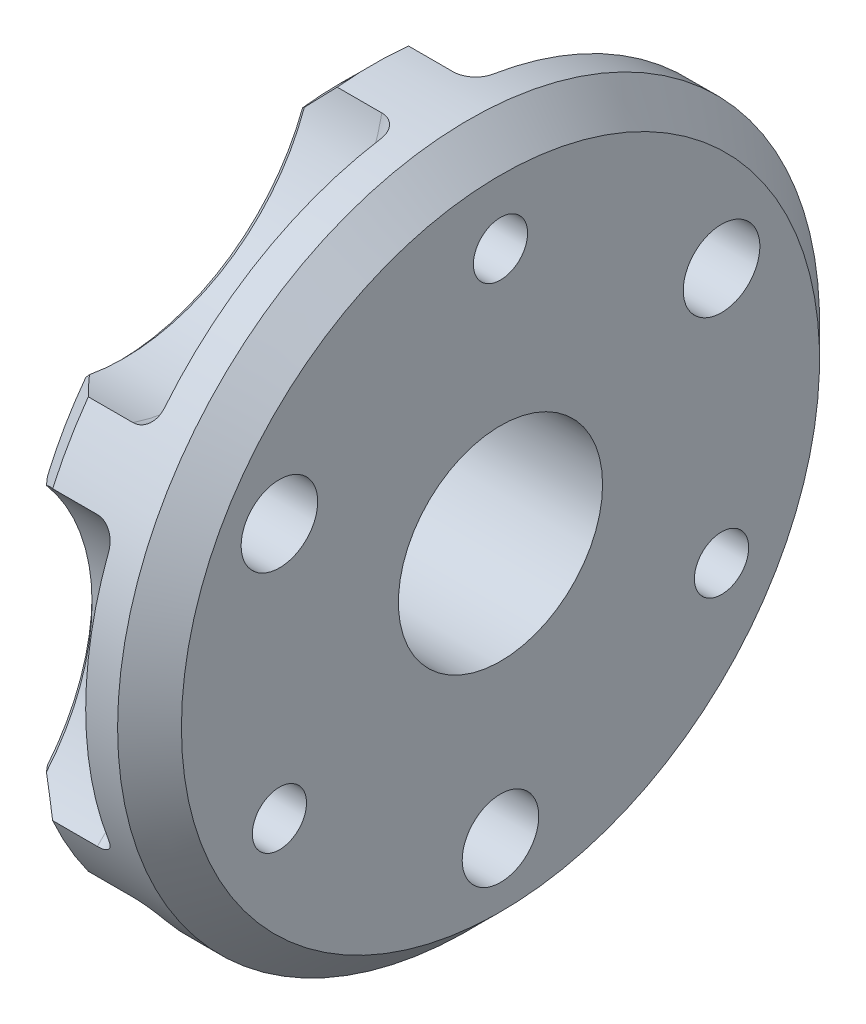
ISO-10303-21;
HEADER;
FILE_DESCRIPTION(('STEP AP214'),'2;1');
FILE_NAME('part.step','',(''),(''),'','','');
FILE_SCHEMA(('AUTOMOTIVE_DESIGN { 1 0 10303 214 1 1 1 1 }'));
ENDSEC;
DATA;
#1=APPLICATION_CONTEXT('core data for automotive mechanical design processes');
#2=APPLICATION_PROTOCOL_DEFINITION('international standard','automotive_design',2000,#1);
#3=PRODUCT_CONTEXT('',#1,'mechanical');
#4=PRODUCT('Part','Part','',(#3));
#5=PRODUCT_RELATED_PRODUCT_CATEGORY('part','',(#4));
#6=PRODUCT_DEFINITION_FORMATION('','',#4);
#7=PRODUCT_DEFINITION_CONTEXT('part definition',#1,'design');
#8=PRODUCT_DEFINITION('design','',#6,#7);
#9=PRODUCT_DEFINITION_SHAPE('','',#8);
#10=(LENGTH_UNIT() NAMED_UNIT(*) SI_UNIT(.MILLI.,.METRE.));
#11=(NAMED_UNIT(*) PLANE_ANGLE_UNIT() SI_UNIT($,.RADIAN.));
#12=(NAMED_UNIT(*) SI_UNIT($,.STERADIAN.) SOLID_ANGLE_UNIT());
#13=UNCERTAINTY_MEASURE_WITH_UNIT(LENGTH_MEASURE(1.E-05),#10,'distance_accuracy_value','');
#14=(GEOMETRIC_REPRESENTATION_CONTEXT(3) GLOBAL_UNCERTAINTY_ASSIGNED_CONTEXT((#13)) GLOBAL_UNIT_ASSIGNED_CONTEXT((#10,
#11,#12)) REPRESENTATION_CONTEXT('',''));
#15=CARTESIAN_POINT('',(0.,0.,0.));
#16=DIRECTION('',(0.,0.,1.));
#17=DIRECTION('',(1.,0.,0.));
#18=AXIS2_PLACEMENT_3D('',#15,#16,#17);
#19=CARTESIAN_POINT('',(0.,0.,0.));
#20=DIRECTION('',(-1.,0.,0.));
#21=DIRECTION('',(0.,0.,1.));
#22=AXIS2_PLACEMENT_3D('',#19,#20,#21);
#23=CYLINDRICAL_SURFACE('',#22,29.);
#24=CARTESIAN_POINT('',(4.00000000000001,0.,0.));
#25=DIRECTION('',(-1.,0.,0.));
#26=DIRECTION('',(0.,0.,1.));
#27=AXIS2_PLACEMENT_3D('',#24,#25,#26);
#28=CIRCLE('',#27,29.);
#29=CARTESIAN_POINT('',(4.00000000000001,0.,29.));
#30=VERTEX_POINT('',#29);
#31=EDGE_CURVE('E289',#30,#30,#28,.T.);
#32=ORIENTED_EDGE('',*,*,#31,.T.);
#33=EDGE_LOOP('',(#32));
#34=FACE_BOUND('',#33,.T.);
#35=CARTESIAN_POINT('',(1.,0.,0.));
#36=DIRECTION('',(-1.,0.,0.));
#37=DIRECTION('',(0.,0.,1.));
#38=AXIS2_PLACEMENT_3D('',#35,#36,#37);
#39=CIRCLE('',#38,29.);
#40=CARTESIAN_POINT('',(1.,0.,29.));
#41=VERTEX_POINT('',#40);
#42=EDGE_CURVE('E489',#41,#41,#39,.T.);
#43=ORIENTED_EDGE('',*,*,#42,.F.);
#44=EDGE_LOOP('',(#43));
#45=FACE_BOUND('',#44,.T.);
#46=ADVANCED_FACE('F34',(#34,#45),#23,.T.);
#47=CARTESIAN_POINT('',(0.,0.,0.));
#48=DIRECTION('',(1.,0.,0.));
#49=DIRECTION('',(0.,0.,-1.));
#50=AXIS2_PLACEMENT_3D('',#47,#48,#49);
#51=CYLINDRICAL_SURFACE('',#50,16.);
#52=CARTESIAN_POINT('',(29.,0.,0.));
#53=DIRECTION('',(1.,0.,0.));
#54=DIRECTION('',(0.,0.,-1.));
#55=AXIS2_PLACEMENT_3D('',#52,#53,#54);
#56=CIRCLE('',#55,16.);
#57=CARTESIAN_POINT('',(29.,0.,-16.));
#58=VERTEX_POINT('',#57);
#59=EDGE_CURVE('E486',#58,#58,#56,.T.);
#60=ORIENTED_EDGE('',*,*,#59,.T.);
#61=EDGE_LOOP('',(#60));
#62=FACE_BOUND('',#61,.T.);
#63=CARTESIAN_POINT('',(1.,0.,0.));
#64=DIRECTION('',(-1.,0.,0.));
#65=DIRECTION('',(0.,0.,1.));
#66=AXIS2_PLACEMENT_3D('',#63,#64,#65);
#67=CIRCLE('',#66,16.);
#68=CARTESIAN_POINT('',(1.,0.,16.));
#69=VERTEX_POINT('',#68);
#70=EDGE_CURVE('E38',#69,#69,#67,.F.);
#71=ORIENTED_EDGE('',*,*,#70,.F.);
#72=EDGE_LOOP('',(#71));
#73=FACE_BOUND('',#72,.T.);
#74=ADVANCED_FACE('F498',(#62,#73),#51,.F.);
#75=CARTESIAN_POINT('',(9.00000000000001,0.,0.));
#76=DIRECTION('',(1.,0.,0.));
#77=DIRECTION('',(0.,0.,-1.));
#78=AXIS2_PLACEMENT_3D('',#75,#76,#77);
#79=CONICAL_SURFACE('',#78,55.,0.785398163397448);
#80=CARTESIAN_POINT('',(9.00020000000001,54.7156850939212,-5.5871105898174));
#81=CARTESIAN_POINT('',(8.57359887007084,54.2778634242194,-5.6750427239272));
#82=CARTESIAN_POINT('',(8.14873985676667,53.8403333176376,-5.77305079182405));
#83=CARTESIAN_POINT('',(7.30401376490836,52.9666592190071,-5.98962767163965));
#84=CARTESIAN_POINT('',(6.88414102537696,52.5305141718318,-6.10817017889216));
#85=CARTESIAN_POINT('',(6.04979320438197,51.6592857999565,-6.36644944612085));
#86=CARTESIAN_POINT('',(5.63531827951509,51.2242025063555,-6.50618681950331));
#87=CARTESIAN_POINT('',(4.81250218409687,50.3548010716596,-6.80778883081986));
#88=CARTESIAN_POINT('',(4.4041694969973,49.9204846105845,-6.96968142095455));
#89=CARTESIAN_POINT('',(3.99980000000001,49.4869514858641,-7.14294285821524));
#90=B_SPLINE_CURVE_WITH_KNOTS('',3,(#80,#81,#82,#83,#84,#85,#86,#87,#88,#89),.UNSPECIFIED.,.F.,
.F.,(4,2,2,2,4),(0.,1.85269809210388,3.70304019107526,5.55343585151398,7.4061879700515),.UNSPECIFIED.);
#91=CARTESIAN_POINT('',(9.00000000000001,54.7154798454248,-5.58715180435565));
#92=VERTEX_POINT('',#91);
#93=CARTESIAN_POINT('',(4.99999999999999,50.5526335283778,-6.74027027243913));
#94=VERTEX_POINT('',#93);
#95=EDGE_CURVE('E243',#92,#94,#90,.T.);
#96=ORIENTED_EDGE('',*,*,#95,.T.);
#97=CARTESIAN_POINT('',(5.,50.5526335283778,-6.74027027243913));
#98=CARTESIAN_POINT('',(4.83344875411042,50.4009747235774,-6.61750385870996));
#99=CARTESIAN_POINT('',(4.6668397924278,50.2488692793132,-6.49537747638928));
#100=CARTESIAN_POINT('',(4.33350645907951,49.943765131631,-6.25240479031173));
#101=CARTESIAN_POINT('',(4.1667820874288,49.7907664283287,-6.13155848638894));
#102=CARTESIAN_POINT('',(4.00000000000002,49.6373210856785,-6.01135221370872));
#103=B_SPLINE_CURVE_WITH_KNOTS('',3,(#97,#98,#99,#100,#101,#102),.UNSPECIFIED.,.F.,.F.,(4,2,4),
(0.,0.769600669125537,1.5392012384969),.UNSPECIFIED.);
#104=CARTESIAN_POINT('',(4.00000000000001,49.6373210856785,-6.01135221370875));
#105=VERTEX_POINT('',#104);
#106=EDGE_CURVE('E810',#94,#105,#103,.T.);
#107=ORIENTED_EDGE('',*,*,#106,.T.);
#108=CARTESIAN_POINT('',(4.00000000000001,0.,0.));
#109=DIRECTION('',(-1.,0.,0.));
#110=DIRECTION('',(0.,0.,1.));
#111=AXIS2_PLACEMENT_3D('',#108,#109,#110);
#112=CIRCLE('',#111,50.);
#113=CARTESIAN_POINT('',(4.00000000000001,49.6373210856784,6.01135221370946));
#114=VERTEX_POINT('',#113);
#115=EDGE_CURVE('E271',#114,#105,#112,.T.);
#116=ORIENTED_EDGE('',*,*,#115,.F.);
#117=CARTESIAN_POINT('',(4.00000000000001,49.6373210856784,6.01135221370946));
#118=CARTESIAN_POINT('',(4.1667820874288,49.7907664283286,6.13155848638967));
#119=CARTESIAN_POINT('',(4.3335064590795,49.9437651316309,6.25240479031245));
#120=CARTESIAN_POINT('',(4.6668397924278,50.2488692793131,6.49537747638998));
#121=CARTESIAN_POINT('',(4.83344875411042,50.4009747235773,6.61750385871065));
#122=CARTESIAN_POINT('',(5.,50.5526335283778,6.74027027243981));
#123=B_SPLINE_CURVE_WITH_KNOTS('',3,(#117,#118,#119,#120,#121,#122),.UNSPECIFIED.,.F.,.F.,(4,2,
4),(0.,0.769600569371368,1.53920123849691),.UNSPECIFIED.);
#124=CARTESIAN_POINT('',(5.,50.5526335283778,6.74027027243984));
#125=VERTEX_POINT('',#124);
#126=EDGE_CURVE('E805',#114,#125,#123,.T.);
#127=ORIENTED_EDGE('',*,*,#126,.T.);
#128=CARTESIAN_POINT('',(3.99980000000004,49.4869514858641,7.14294285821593));
#129=CARTESIAN_POINT('',(4.40416949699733,49.9204846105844,6.96968142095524));
#130=CARTESIAN_POINT('',(4.8125021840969,50.3548010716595,6.80778883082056));
#131=CARTESIAN_POINT('',(5.63531827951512,51.2242025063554,6.50618681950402));
#132=CARTESIAN_POINT('',(6.049793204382,51.6592857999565,6.36644944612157));
#133=CARTESIAN_POINT('',(6.88414102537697,52.5305141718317,6.1081701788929));
#134=CARTESIAN_POINT('',(7.30401376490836,52.9666592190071,5.9896276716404));
#135=CARTESIAN_POINT('',(8.14873985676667,53.8403333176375,5.77305079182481));
#136=CARTESIAN_POINT('',(8.57359887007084,54.2778634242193,5.67504272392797));
#137=CARTESIAN_POINT('',(9.00020000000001,54.7156850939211,5.58711058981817));
#138=B_SPLINE_CURVE_WITH_KNOTS('',3,(#128,#129,#130,#131,#132,#133,#134,#135,#136,#137),
.UNSPECIFIED.,.F.,.F.,(4,2,2,2,4),(0.,1.85275211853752,3.70314777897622,5.55348987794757,
7.40618797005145),.UNSPECIFIED.);
#139=CARTESIAN_POINT('',(9.00000000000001,54.7154798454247,5.58715180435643));
#140=VERTEX_POINT('',#139);
#141=EDGE_CURVE('E257',#125,#140,#138,.T.);
#142=ORIENTED_EDGE('',*,*,#141,.T.);
#143=CARTESIAN_POINT('',(9.00000000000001,0.,0.));
#144=DIRECTION('',(-1.,0.,0.));
#145=DIRECTION('',(0.,0.,1.));
#146=AXIS2_PLACEMENT_3D('',#143,#144,#145);
#147=CIRCLE('',#146,55.);
#148=EDGE_CURVE('E238',#140,#92,#147,.T.);
#149=ORIENTED_EDGE('',*,*,#148,.T.);
#150=EDGE_LOOP('',(#96,#107,#116,#127,#142,#149));
#151=FACE_BOUND('',#150,.T.);
#152=ADVANCED_FACE('F255',(#151),#79,.T.);
#153=CARTESIAN_POINT('',(4.00000000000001,30.0246442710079,-39.9815049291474));
#154=VERTEX_POINT('',#153);
#155=CARTESIAN_POINT('',(4.00000000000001,19.6126768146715,-45.992857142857));
#156=VERTEX_POINT('',#155);
#157=EDGE_CURVE('E279',#154,#156,#112,.T.);
#158=ORIENTED_EDGE('',*,*,#157,.F.);
#159=CARTESIAN_POINT('',(4.00000000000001,30.0246442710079,-39.9815049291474));
#160=CARTESIAN_POINT('',(4.16678208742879,30.2054686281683,-40.0542893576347));
#161=CARTESIAN_POINT('',(4.3335064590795,30.38662394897,-40.1263669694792));
#162=CARTESIAN_POINT('',(4.66683979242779,30.74959654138,-40.2691085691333));
#163=CARTESIAN_POINT('',(4.83344875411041,30.9314138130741,-40.3397725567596));
#164=CARTESIAN_POINT('',(5.,31.1135620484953,-40.4097297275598));
#165=B_SPLINE_CURVE_WITH_KNOTS('',3,(#159,#160,#161,#162,#163,#164),.UNSPECIFIED.,.F.,.F.,(4,2,
4),(0.,0.769600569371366,1.53920123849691),.UNSPECIFIED.);
#166=CARTESIAN_POINT('',(4.99999999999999,31.1135620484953,-40.4097297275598));
#167=VERTEX_POINT('',#166);
#168=EDGE_CURVE('E824',#154,#167,#165,.T.);
#169=ORIENTED_EDGE('',*,*,#168,.T.);
#170=CARTESIAN_POINT('',(3.99980000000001,30.9294457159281,-39.285485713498));
#171=CARTESIAN_POINT('',(4.4041694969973,30.9961634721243,-39.7475671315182));
#172=CARTESIAN_POINT('',(4.81250218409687,31.0731186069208,-40.2046425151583));
#173=CARTESIAN_POINT('',(5.6353182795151,31.2466243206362,-41.1083672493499));
#174=CARTESIAN_POINT('',(6.04979320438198,31.3431498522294,-41.5550291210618));
#175=CARTESIAN_POINT('',(6.88414102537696,31.5550876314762,-42.4386746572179));
#176=CARTESIAN_POINT('',(7.30401376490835,31.6704993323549,-42.8756586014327));
#177=CARTESIAN_POINT('',(8.14873985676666,31.9197753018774,-43.740571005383));
#178=CARTESIAN_POINT('',(8.57359887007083,32.0536628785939,-44.1684872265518));
#179=CARTESIAN_POINT('',(9.00020000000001,32.1964222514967,-44.5916179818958));
#180=B_SPLINE_CURVE_WITH_KNOTS('',3,(#170,#171,#172,#173,#174,#175,#176,#177,#178,#179),
.UNSPECIFIED.,.F.,.F.,(4,2,2,2,4),(0.,1.85275211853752,3.70314777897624,5.5534898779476,
7.4061879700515),.UNSPECIFIED.);
#181=CARTESIAN_POINT('',(9.00000000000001,32.1963553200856,-44.5914196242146));
#182=VERTEX_POINT('',#181);
#183=EDGE_CURVE('E456',#167,#182,#180,.T.);
#184=ORIENTED_EDGE('',*,*,#183,.T.);
#185=CARTESIAN_POINT('',(9.00000000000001,22.5191245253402,-50.1785714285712));
#186=VERTEX_POINT('',#185);
#187=EDGE_CURVE('E260',#182,#186,#147,.T.);
#188=ORIENTED_EDGE('',*,*,#187,.T.);
#189=CARTESIAN_POINT('',(20.7887940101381,28.4339466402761,-60.4338786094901));
#190=CARTESIAN_POINT('',(20.2953290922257,28.2755318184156,-59.963043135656));
#191=CARTESIAN_POINT('',(19.8011829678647,28.105660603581,-59.4967915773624));
#192=CARTESIAN_POINT('',(18.8120831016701,27.7433356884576,-58.5740129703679));
#193=CARTESIAN_POINT('',(18.3171293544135,27.5508818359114,-58.1174859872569));
#194=CARTESIAN_POINT('',(17.3266296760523,27.1435818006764,-57.214404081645));
#195=CARTESIAN_POINT('',(16.8310835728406,26.9287200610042,-56.7678563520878));
#196=CARTESIAN_POINT('',(15.840408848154,26.4769831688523,-55.8856472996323));
#197=CARTESIAN_POINT('',(15.3452802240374,26.2401081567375,-55.449985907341));
#198=CARTESIAN_POINT('',(13.8671482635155,25.4995851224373,-54.1650685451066));
#199=CARTESIAN_POINT('',(12.8854723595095,24.9636021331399,-53.3324774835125));
#200=CARTESIAN_POINT('',(11.4210711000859,24.0953962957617,-52.1210041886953));
#201=CARTESIAN_POINT('',(10.9343565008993,23.7953352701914,-51.7234679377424));
#202=CARTESIAN_POINT('',(9.96440324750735,23.1735809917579,-50.9412818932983));
#203=CARTESIAN_POINT('',(9.48116430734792,22.8518895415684,-50.5566310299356));
#204=CARTESIAN_POINT('',(8.57437011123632,22.2247661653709,-49.8441462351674));
#205=CARTESIAN_POINT('',(8.15032324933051,21.9216976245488,-49.5148538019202));
#206=CARTESIAN_POINT('',(7.30669028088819,21.2981689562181,-48.867323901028));
#207=CARTESIAN_POINT('',(6.88710363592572,20.9777109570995,-48.5490850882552));
#208=CARTESIAN_POINT('',(6.05222266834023,20.3181120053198,-47.9232799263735));
#209=CARTESIAN_POINT('',(5.6369428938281,19.9789232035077,-47.6157445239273));
#210=CARTESIAN_POINT('',(4.81303867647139,19.282165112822,-47.0128223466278));
#211=CARTESIAN_POINT('',(4.40441428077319,18.9245956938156,-46.7174356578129));
#212=CARTESIAN_POINT('',(3.41684233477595,18.028612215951,-46.0120347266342));
#213=CARTESIAN_POINT('',(2.84220898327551,17.4799557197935,-45.6088838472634));
#214=CARTESIAN_POINT('',(1.71492769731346,16.3406733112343,-44.8314041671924));
#215=CARTESIAN_POINT('',(1.16228612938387,15.7500353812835,-44.4570836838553));
#216=CARTESIAN_POINT('',(0.0886928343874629,14.5264519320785,-43.7420058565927));
#217=CARTESIAN_POINT('',(-0.432381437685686,13.8936931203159,-43.4011150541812));
#218=CARTESIAN_POINT('',(-1.43513778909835,12.580718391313,-42.7555424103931));
#219=CARTESIAN_POINT('',(-1.91684670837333,11.9005354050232,-42.4508358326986));
#220=CARTESIAN_POINT('',(-2.77697206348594,10.567671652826,-41.9147595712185));
#221=CARTESIAN_POINT('',(-3.16091664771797,9.92038770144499,-41.6790007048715));
#222=CARTESIAN_POINT('',(-3.69684141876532,8.91720384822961,-41.3537497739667));
#223=CARTESIAN_POINT('',(-3.86911843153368,8.57672757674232,-41.2498869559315));
#224=CARTESIAN_POINT('',(-4.19823763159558,7.88516308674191,-41.0525727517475));
#225=CARTESIAN_POINT('',(-4.35506902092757,7.53406766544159,-40.9591286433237));
#226=CARTESIAN_POINT('',(-4.50317634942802,7.17778907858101,-40.8713312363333));
#227=B_SPLINE_CURVE_WITH_KNOTS('',3,(#189,#190,#191,#192,#193,#194,#195,#196,#197,#198,#199,
#200,#201,#202,#203,#204,#205,#206,#207,#208,#209,#210,#211,#212,#213,#214,#215,#216,#217,#218,
#219,#220,#221,#222,#223,#224,#225,#226),.UNSPECIFIED.,.F.,.F.,(4,2,2,2,2,2,2,2,2,2,2,2,2,2,2,2,
2,2,4),(0.,2.10049162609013,4.2009974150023,6.30297134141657,8.40493186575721,12.5837614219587,
14.6725958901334,16.7612564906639,18.6104874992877,20.459492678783,22.3134619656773,
24.1674443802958,26.8386137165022,29.5105508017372,32.1713451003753,34.8303098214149,
37.1926478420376,38.3785155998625,39.5652065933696),.UNSPECIFIED.);
#228=CARTESIAN_POINT('',(5.,19.4390714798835,-47.1499999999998));
#229=VERTEX_POINT('',#228);
#230=EDGE_CURVE('E448',#186,#229,#227,.T.);
#231=ORIENTED_EDGE('',*,*,#230,.T.);
#232=CARTESIAN_POINT('',(5.,19.4390714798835,-47.1499999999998));
#233=CARTESIAN_POINT('',(4.83344875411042,19.4695609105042,-46.9572764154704));
#234=CARTESIAN_POINT('',(4.6668397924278,19.4992727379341,-46.7644860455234));
#235=CARTESIAN_POINT('',(4.33350645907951,19.5571411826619,-46.3787717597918));
#236=CARTESIAN_POINT('',(4.1667820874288,19.5852978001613,-46.1858478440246));
#237=CARTESIAN_POINT('',(4.00000000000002,19.6126768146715,-45.992857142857));
#238=B_SPLINE_CURVE_WITH_KNOTS('',3,(#232,#233,#234,#235,#236,#237),.UNSPECIFIED.,.F.,.F.,(4,2,
4),(0.,0.76960066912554,1.5392012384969),.UNSPECIFIED.);
#239=EDGE_CURVE('E831',#229,#156,#238,.T.);
#240=ORIENTED_EDGE('',*,*,#239,.T.);
#241=EDGE_LOOP('',(#158,#169,#184,#188,#231,#240));
#242=FACE_BOUND('',#241,.T.);
#243=ADVANCED_FACE('F506',(#242),#79,.T.);
#244=CARTESIAN_POINT('',(4.00000000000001,-19.6126768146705,-45.9928571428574));
#245=VERTEX_POINT('',#244);
#246=CARTESIAN_POINT('',(4.00000000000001,-30.024644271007,-39.981504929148));
#247=VERTEX_POINT('',#246);
#248=EDGE_CURVE('E285',#245,#247,#112,.T.);
#249=ORIENTED_EDGE('',*,*,#248,.F.);
#250=CARTESIAN_POINT('',(4.00000000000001,-19.6126768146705,-45.9928571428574));
#251=CARTESIAN_POINT('',(4.1667820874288,-19.5852978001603,-46.185847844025));
#252=CARTESIAN_POINT('',(4.33350645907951,-19.5571411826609,-46.3787717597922));
#253=CARTESIAN_POINT('',(4.6668397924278,-19.4992727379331,-46.7644860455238));
#254=CARTESIAN_POINT('',(4.83344875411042,-19.4695609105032,-46.9572764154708));
#255=CARTESIAN_POINT('',(5.00000000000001,-19.4390714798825,-47.1500000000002));
#256=B_SPLINE_CURVE_WITH_KNOTS('',3,(#250,#251,#252,#253,#254,#255),.UNSPECIFIED.,.F.,.F.,(4,2,
4),(0.,0.769600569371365,1.5392012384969),.UNSPECIFIED.);
#257=CARTESIAN_POINT('',(5.,-19.4390714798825,-47.1500000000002));
#258=VERTEX_POINT('',#257);
#259=EDGE_CURVE('E840',#245,#258,#256,.T.);
#260=ORIENTED_EDGE('',*,*,#259,.T.);
#261=CARTESIAN_POINT('',(-4.50317634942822,-7.17778907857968,-40.8713312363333));
#262=CARTESIAN_POINT('',(-4.29167317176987,-7.68643963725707,-40.9966942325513));
#263=CARTESIAN_POINT('',(-4.06250319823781,-8.18446136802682,-41.1335229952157));
#264=CARTESIAN_POINT('',(-3.57442657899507,-9.15857222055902,-41.4276470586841));
#265=CARTESIAN_POINT('',(-3.31556235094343,-9.63469129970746,-41.5849132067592));
#266=CARTESIAN_POINT('',(-2.77464474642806,-10.5630504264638,-41.9168457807));
#267=CARTESIAN_POINT('',(-2.49273495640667,-11.0154132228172,-42.0914057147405));
#268=CARTESIAN_POINT('',(-1.90846790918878,-11.9000612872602,-42.4569844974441));
#269=CARTESIAN_POINT('',(-1.60610158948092,-12.3323375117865,-42.6480106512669));
#270=CARTESIAN_POINT('',(-0.896315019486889,-13.2973594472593,-43.1013098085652));
#271=CARTESIAN_POINT('',(-0.483430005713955,-13.8238100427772,-43.3684190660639));
#272=CARTESIAN_POINT('',(0.364179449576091,-14.8464575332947,-43.9246956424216));
#273=CARTESIAN_POINT('',(0.798904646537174,-15.3426533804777,-44.213863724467));
#274=CARTESIAN_POINT('',(1.68680214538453,-16.3077682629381,-44.8130962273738));
#275=CARTESIAN_POINT('',(2.14001892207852,-16.7766140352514,-45.1232123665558));
#276=CARTESIAN_POINT('',(3.06025904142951,-17.6871316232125,-45.7621234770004));
#277=CARTESIAN_POINT('',(3.52728186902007,-18.1288044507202,-46.090917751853));
#278=CARTESIAN_POINT('',(4.40412634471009,-18.9243387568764,-46.7172312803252));
#279=CARTESIAN_POINT('',(4.81247632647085,-19.2816740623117,-47.0124162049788));
#280=CARTESIAN_POINT('',(5.63578843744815,-19.9779623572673,-47.6148943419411));
#281=CARTESIAN_POINT('',(6.0507501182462,-20.3169165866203,-47.9221867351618));
#282=CARTESIAN_POINT('',(6.88560310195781,-20.9765573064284,-48.5479497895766));
#283=CARTESIAN_POINT('',(7.30548780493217,-21.2972654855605,-48.866406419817));
#284=CARTESIAN_POINT('',(8.14971944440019,-21.921266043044,-49.5143848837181));
#285=CARTESIAN_POINT('',(8.57406688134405,-22.2245564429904,-49.8439079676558));
#286=CARTESIAN_POINT('',(9.48175215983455,-22.8522961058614,-50.5570929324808));
#287=CARTESIAN_POINT('',(9.96558466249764,-23.1743674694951,-50.9422223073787));
#288=CARTESIAN_POINT('',(10.9367347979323,-23.7968305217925,-51.7253981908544));
#289=CARTESIAN_POINT('',(11.4240527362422,-24.0972202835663,-52.1234458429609));
#290=CARTESIAN_POINT('',(12.8902725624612,-24.9663347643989,-53.3364987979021));
#291=CARTESIAN_POINT('',(13.873170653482,-25.5028190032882,-54.1702023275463));
#292=CARTESIAN_POINT('',(15.3519249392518,-26.2433272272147,-55.4558135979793));
#293=CARTESIAN_POINT('',(15.8464539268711,-26.4798204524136,-55.8909922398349));
#294=CARTESIAN_POINT('',(16.8359262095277,-26.9308465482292,-56.7722074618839));
#295=CARTESIAN_POINT('',(17.3308695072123,-27.1453792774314,-57.2182441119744));
#296=CARTESIAN_POINT('',(18.3201592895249,-27.5520733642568,-58.1202742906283));
#297=CARTESIAN_POINT('',(18.8145059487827,-27.7442504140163,-58.5762605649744));
#298=CARTESIAN_POINT('',(19.8023929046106,-28.1060765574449,-59.497933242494));
#299=CARTESIAN_POINT('',(20.2959332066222,-28.2757258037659,-59.9636195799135));
#300=CARTESIAN_POINT('',(20.7887940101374,-28.4339466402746,-60.43387860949));
#301=B_SPLINE_CURVE_WITH_KNOTS('',3,(#261,#262,#263,#264,#265,#266,#267,#268,#269,#270,#271,
#272,#273,#274,#275,#276,#277,#278,#279,#280,#281,#282,#283,#284,#285,#286,#287,#288,#289,#290,
#291,#292,#293,#294,#295,#296,#297,#298,#299,#300),.UNSPECIFIED.,.F.,.F.,(4,2,2,2,2,2,2,2,2,2,2,
2,2,2,2,2,2,2,2,4),(0.,1.69377961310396,3.38516913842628,5.06672399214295,6.7490287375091,
8.90867604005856,11.0683980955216,13.2336622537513,15.3988457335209,17.2515592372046,
19.1041476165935,20.9544857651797,22.8050336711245,24.8962471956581,26.987646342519,
31.1716121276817,33.2710157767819,35.3704329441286,37.4683674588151,39.5662877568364),.UNSPECIFIED.);
#302=CARTESIAN_POINT('',(9.00000000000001,-22.5191245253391,-50.1785714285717));
#303=VERTEX_POINT('',#302);
#304=EDGE_CURVE('E433',#258,#303,#301,.T.);
#305=ORIENTED_EDGE('',*,*,#304,.T.);
#306=CARTESIAN_POINT('',(9.00000000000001,-32.1963553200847,-44.5914196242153));
#307=VERTEX_POINT('',#306);
#308=EDGE_CURVE('E267',#303,#307,#147,.T.);
#309=ORIENTED_EDGE('',*,*,#308,.T.);
#310=CARTESIAN_POINT('',(9.00020000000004,-32.1964222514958,-44.5916179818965));
#311=CARTESIAN_POINT('',(8.57359887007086,-32.0536628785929,-44.1684872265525));
#312=CARTESIAN_POINT('',(8.14873985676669,-31.9197753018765,-43.7405710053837));
#313=CARTESIAN_POINT('',(7.30401376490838,-31.670499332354,-42.8756586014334));
#314=CARTESIAN_POINT('',(6.88414102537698,-31.5550876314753,-42.4386746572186));
#315=CARTESIAN_POINT('',(6.04979320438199,-31.3431498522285,-41.5550291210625));
#316=CARTESIAN_POINT('',(5.63531827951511,-31.2466243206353,-41.1083672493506));
#317=CARTESIAN_POINT('',(4.81250218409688,-31.07311860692,-40.204642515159));
#318=CARTESIAN_POINT('',(4.40416949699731,-30.9961634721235,-39.7475671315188));
#319=CARTESIAN_POINT('',(3.99980000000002,-30.9294457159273,-39.2854857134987));
#320=B_SPLINE_CURVE_WITH_KNOTS('',3,(#310,#311,#312,#313,#314,#315,#316,#317,#318,#319),
.UNSPECIFIED.,.F.,.F.,(4,2,2,2,4),(0.,1.8526980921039,3.70304019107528,5.553435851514,
7.40618797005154),.UNSPECIFIED.);
#321=CARTESIAN_POINT('',(5.00000000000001,-31.1135620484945,-40.4097297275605));
#322=VERTEX_POINT('',#321);
#323=EDGE_CURVE('E425',#307,#322,#320,.T.);
#324=ORIENTED_EDGE('',*,*,#323,.T.);
#325=CARTESIAN_POINT('',(5.00000000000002,-31.1135620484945,-40.4097297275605));
#326=CARTESIAN_POINT('',(4.83344875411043,-30.9314138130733,-40.3397725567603));
#327=CARTESIAN_POINT('',(4.66683979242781,-30.7495965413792,-40.2691085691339));
#328=CARTESIAN_POINT('',(4.33350645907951,-30.3866239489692,-40.1263669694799));
#329=CARTESIAN_POINT('',(4.1667820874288,-30.2054686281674,-40.0542893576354));
#330=CARTESIAN_POINT('',(4.00000000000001,-30.024644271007,-39.981504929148));
#331=B_SPLINE_CURVE_WITH_KNOTS('',3,(#325,#326,#327,#328,#329,#330),.UNSPECIFIED.,.F.,.F.,(4,2,
4),(0.,0.769600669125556,1.53920123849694),.UNSPECIFIED.);
#332=EDGE_CURVE('E830',#322,#247,#331,.T.);
#333=ORIENTED_EDGE('',*,*,#332,.T.);
#334=EDGE_LOOP('',(#249,#260,#305,#309,#324,#333));
#335=FACE_BOUND('',#334,.T.);
#336=ADVANCED_FACE('F868',(#335),#79,.T.);
#337=CARTESIAN_POINT('',(4.00000000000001,-49.6373210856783,-6.0113522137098));
#338=VERTEX_POINT('',#337);
#339=CARTESIAN_POINT('',(4.00000000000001,-49.6373210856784,6.01135221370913));
#340=VERTEX_POINT('',#339);
#341=EDGE_CURVE('E293',#338,#340,#112,.T.);
#342=ORIENTED_EDGE('',*,*,#341,.F.);
#343=CARTESIAN_POINT('',(4.00000000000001,-49.6373210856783,-6.0113522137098));
#344=CARTESIAN_POINT('',(4.1667820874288,-49.7907664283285,-6.13155848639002));
#345=CARTESIAN_POINT('',(4.33350645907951,-49.9437651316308,-6.2524047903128));
#346=CARTESIAN_POINT('',(4.66683979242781,-50.2488692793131,-6.49537747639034));
#347=CARTESIAN_POINT('',(4.83344875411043,-50.4009747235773,-6.61750385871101));
#348=CARTESIAN_POINT('',(5.00000000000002,-50.5526335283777,-6.74027027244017));
#349=B_SPLINE_CURVE_WITH_KNOTS('',3,(#343,#344,#345,#346,#347,#348),.UNSPECIFIED.,.F.,.F.,(4,2,
4),(0.,0.769600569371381,1.53920123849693),.UNSPECIFIED.);
#350=CARTESIAN_POINT('',(5.00000000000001,-50.5526335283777,-6.74027027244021));
#351=VERTEX_POINT('',#350);
#352=EDGE_CURVE('E850',#338,#351,#349,.T.);
#353=ORIENTED_EDGE('',*,*,#352,.T.);
#354=CARTESIAN_POINT('',(3.99980000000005,-49.486951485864,-7.1429428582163));
#355=CARTESIAN_POINT('',(4.40416949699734,-49.9204846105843,-6.9696814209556));
#356=CARTESIAN_POINT('',(4.8125021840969,-50.3548010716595,-6.80778883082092));
#357=CARTESIAN_POINT('',(5.63531827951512,-51.2242025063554,-6.5061868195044));
#358=CARTESIAN_POINT('',(6.049793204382,-51.6592857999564,-6.36644944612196));
#359=CARTESIAN_POINT('',(6.88414102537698,-52.5305141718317,-6.1081701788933));
#360=CARTESIAN_POINT('',(7.30401376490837,-52.966659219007,-5.98962767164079));
#361=CARTESIAN_POINT('',(8.14873985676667,-53.8403333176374,-5.7730507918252));
#362=CARTESIAN_POINT('',(8.57359887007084,-54.2778634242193,-5.67504272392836));
#363=CARTESIAN_POINT('',(9.00020000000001,-54.7156850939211,-5.58711058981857));
#364=B_SPLINE_CURVE_WITH_KNOTS('',3,(#354,#355,#356,#357,#358,#359,#360,#361,#362,#363),
.UNSPECIFIED.,.F.,.F.,(4,2,2,2,4),(0.,1.85275211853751,3.70314777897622,5.55348987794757,
7.40618797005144),.UNSPECIFIED.);
#365=CARTESIAN_POINT('',(9.00000000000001,-54.7154798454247,-5.58715180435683));
#366=VERTEX_POINT('',#365);
#367=EDGE_CURVE('E410',#351,#366,#364,.T.);
#368=ORIENTED_EDGE('',*,*,#367,.T.);
#369=CARTESIAN_POINT('',(9.00000000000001,-54.7154798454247,5.58715180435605));
#370=VERTEX_POINT('',#369);
#371=EDGE_CURVE('E277',#366,#370,#147,.T.);
#372=ORIENTED_EDGE('',*,*,#371,.T.);
#373=CARTESIAN_POINT('',(9.00020000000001,-54.7156850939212,5.5871105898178));
#374=CARTESIAN_POINT('',(8.57359887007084,-54.2778634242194,5.6750427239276));
#375=CARTESIAN_POINT('',(8.14873985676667,-53.8403333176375,5.77305079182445));
#376=CARTESIAN_POINT('',(7.30401376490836,-52.9666592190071,5.98962767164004));
#377=CARTESIAN_POINT('',(6.88414102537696,-52.5305141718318,6.10817017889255));
#378=CARTESIAN_POINT('',(6.04979320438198,-51.6592857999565,6.36644944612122));
#379=CARTESIAN_POINT('',(5.6353182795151,-51.2242025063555,6.50618681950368));
#380=CARTESIAN_POINT('',(4.81250218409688,-50.3548010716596,6.80778883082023));
#381=CARTESIAN_POINT('',(4.40416949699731,-49.9204846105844,6.96968142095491));
#382=CARTESIAN_POINT('',(3.99980000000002,-49.4869514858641,7.1429428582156));
#383=B_SPLINE_CURVE_WITH_KNOTS('',3,(#373,#374,#375,#376,#377,#378,#379,#380,#381,#382),
.UNSPECIFIED.,.F.,.F.,(4,2,2,2,4),(0.,1.85269809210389,3.70304019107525,5.55343585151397,
7.4061879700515),.UNSPECIFIED.);
#384=CARTESIAN_POINT('',(5.,-50.5526335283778,6.74027027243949));
#385=VERTEX_POINT('',#384);
#386=EDGE_CURVE('E402',#370,#385,#383,.T.);
#387=ORIENTED_EDGE('',*,*,#386,.T.);
#388=CARTESIAN_POINT('',(5.,-50.5526335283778,6.7402702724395));
#389=CARTESIAN_POINT('',(4.83344875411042,-50.4009747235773,6.61750385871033));
#390=CARTESIAN_POINT('',(4.6668397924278,-50.2488692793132,6.49537747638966));
#391=CARTESIAN_POINT('',(4.33350645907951,-49.9437651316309,6.25240479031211));
#392=CARTESIAN_POINT('',(4.1667820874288,-49.7907664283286,6.13155848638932));
#393=CARTESIAN_POINT('',(4.00000000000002,-49.6373210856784,6.0113522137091));
#394=B_SPLINE_CURVE_WITH_KNOTS('',3,(#388,#389,#390,#391,#392,#393),.UNSPECIFIED.,.F.,.F.,(4,2,
4),(0.,0.769600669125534,1.5392012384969),.UNSPECIFIED.);
#395=EDGE_CURVE('E855',#385,#340,#394,.T.);
#396=ORIENTED_EDGE('',*,*,#395,.T.);
#397=EDGE_LOOP('',(#342,#353,#368,#372,#387,#396));
#398=FACE_BOUND('',#397,.T.);
#399=ADVANCED_FACE('F1110',(#398),#79,.T.);
#400=CARTESIAN_POINT('',(4.00000000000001,-30.0246442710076,39.9815049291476));
#401=VERTEX_POINT('',#400);
#402=CARTESIAN_POINT('',(4.00000000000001,-19.6126768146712,45.9928571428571));
#403=VERTEX_POINT('',#402);
#404=EDGE_CURVE('E288',#401,#403,#112,.T.);
#405=ORIENTED_EDGE('',*,*,#404,.F.);
#406=CARTESIAN_POINT('',(4.00000000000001,-30.0246442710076,39.9815049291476));
#407=CARTESIAN_POINT('',(4.1667820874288,-30.205468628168,40.0542893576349));
#408=CARTESIAN_POINT('',(4.33350645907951,-30.3866239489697,40.1263669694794));
#409=CARTESIAN_POINT('',(4.6668397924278,-30.7495965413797,40.2691085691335));
#410=CARTESIAN_POINT('',(4.83344875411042,-30.9314138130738,40.3397725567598));
#411=CARTESIAN_POINT('',(5.,-31.113562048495,40.4097297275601));
#412=B_SPLINE_CURVE_WITH_KNOTS('',3,(#406,#407,#408,#409,#410,#411),.UNSPECIFIED.,.F.,.F.,(4,2,
4),(0.,0.769600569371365,1.5392012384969),.UNSPECIFIED.);
#413=CARTESIAN_POINT('',(5.,-31.113562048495,40.40972972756));
#414=VERTEX_POINT('',#413);
#415=EDGE_CURVE('E769',#401,#414,#412,.T.);
#416=ORIENTED_EDGE('',*,*,#415,.T.);
#417=CARTESIAN_POINT('',(3.99980000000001,-30.9294457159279,39.2854857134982));
#418=CARTESIAN_POINT('',(4.40416949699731,-30.996163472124,39.7475671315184));
#419=CARTESIAN_POINT('',(4.81250218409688,-31.0731186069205,40.2046425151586));
#420=CARTESIAN_POINT('',(5.6353182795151,-31.2466243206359,41.1083672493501));
#421=CARTESIAN_POINT('',(6.04979320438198,-31.3431498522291,41.5550291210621));
#422=CARTESIAN_POINT('',(6.88414102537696,-31.5550876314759,42.4386746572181));
#423=CARTESIAN_POINT('',(7.30401376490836,-31.6704993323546,42.875658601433));
#424=CARTESIAN_POINT('',(8.14873985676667,-31.9197753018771,43.7405710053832));
#425=CARTESIAN_POINT('',(8.57359887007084,-32.0536628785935,44.168487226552));
#426=CARTESIAN_POINT('',(9.00020000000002,-32.1964222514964,44.591617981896));
#427=B_SPLINE_CURVE_WITH_KNOTS('',3,(#417,#418,#419,#420,#421,#422,#423,#424,#425,#426),
.UNSPECIFIED.,.F.,.F.,(4,2,2,2,4),(0.,1.85275211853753,3.70314777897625,5.55348987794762,
7.40618797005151),.UNSPECIFIED.);
#428=CARTESIAN_POINT('',(9.00000000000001,-32.1963553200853,44.5914196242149));
#429=VERTEX_POINT('',#428);
#430=EDGE_CURVE('E387',#414,#429,#427,.T.);
#431=ORIENTED_EDGE('',*,*,#430,.T.);
#432=CARTESIAN_POINT('',(9.00000000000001,-22.5191245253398,50.1785714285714));
#433=VERTEX_POINT('',#432);
#434=EDGE_CURVE('E270',#429,#433,#147,.T.);
#435=ORIENTED_EDGE('',*,*,#434,.T.);
#436=CARTESIAN_POINT('',(20.7887940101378,-28.4339466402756,60.4338786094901));
#437=CARTESIAN_POINT('',(20.2953290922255,-28.2755318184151,59.963043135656));
#438=CARTESIAN_POINT('',(19.8011829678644,-28.1056606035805,59.4967915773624));
#439=CARTESIAN_POINT('',(18.8120831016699,-27.7433356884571,58.5740129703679));
#440=CARTESIAN_POINT('',(18.3171293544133,-27.5508818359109,58.1174859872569));
#441=CARTESIAN_POINT('',(17.3266296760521,-27.1435818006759,57.214404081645));
#442=CARTESIAN_POINT('',(16.8310835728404,-26.9287200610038,56.7678563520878));
#443=CARTESIAN_POINT('',(15.8404088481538,-26.4769831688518,55.8856472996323));
#444=CARTESIAN_POINT('',(15.3452802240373,-26.2401081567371,55.4499859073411));
#445=CARTESIAN_POINT('',(13.8671482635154,-25.4995851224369,54.1650685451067));
#446=CARTESIAN_POINT('',(12.8854723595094,-24.9636021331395,53.3324774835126));
#447=CARTESIAN_POINT('',(11.4210711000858,-24.0953962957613,52.1210041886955));
#448=CARTESIAN_POINT('',(10.9343565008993,-23.795335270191,51.7234679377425));
#449=CARTESIAN_POINT('',(9.96440324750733,-23.1735809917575,50.9412818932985));
#450=CARTESIAN_POINT('',(9.48116430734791,-22.851889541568,50.5566310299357));
#451=CARTESIAN_POINT('',(8.57437011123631,-22.2247661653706,49.8441462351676));
#452=CARTESIAN_POINT('',(8.1503232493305,-21.9216976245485,49.5148538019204));
#453=CARTESIAN_POINT('',(7.30669028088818,-21.2981689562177,48.8673239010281));
#454=CARTESIAN_POINT('',(6.88710363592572,-20.9777109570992,48.5490850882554));
#455=CARTESIAN_POINT('',(6.05222266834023,-20.3181120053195,47.9232799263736));
#456=CARTESIAN_POINT('',(5.6369428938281,-19.9789232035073,47.6157445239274));
#457=CARTESIAN_POINT('',(4.81303867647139,-19.2821651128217,47.012822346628));
#458=CARTESIAN_POINT('',(4.40441428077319,-18.9245956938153,46.717435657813));
#459=CARTESIAN_POINT('',(3.41684233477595,-18.0286122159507,46.0120347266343));
#460=CARTESIAN_POINT('',(2.84220898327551,-17.4799557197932,45.6088838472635));
#461=CARTESIAN_POINT('',(1.71492769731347,-16.340673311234,44.8314041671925));
#462=CARTESIAN_POINT('',(1.16228612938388,-15.7500353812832,44.4570836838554));
#463=CARTESIAN_POINT('',(0.0886928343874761,-14.5264519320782,43.7420058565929));
#464=CARTESIAN_POINT('',(-0.432381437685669,-13.8936931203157,43.4011150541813));
#465=CARTESIAN_POINT('',(-1.43513778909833,-12.5807183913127,42.7555424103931));
#466=CARTESIAN_POINT('',(-1.91684670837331,-11.9005354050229,42.4508358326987));
#467=CARTESIAN_POINT('',(-2.77697206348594,-10.5676716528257,41.9147595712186));
#468=CARTESIAN_POINT('',(-3.16091664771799,-9.92038770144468,41.6790007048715));
#469=CARTESIAN_POINT('',(-3.69684141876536,-8.91720384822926,41.3537497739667));
#470=CARTESIAN_POINT('',(-3.86911843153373,-8.57672757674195,41.2498869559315));
#471=CARTESIAN_POINT('',(-4.19823763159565,-7.88516308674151,41.0525727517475));
#472=CARTESIAN_POINT('',(-4.35506902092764,-7.53406766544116,40.9591286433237));
#473=CARTESIAN_POINT('',(-4.50317634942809,-7.17778907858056,40.8713312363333));
#474=B_SPLINE_CURVE_WITH_KNOTS('',3,(#436,#437,#438,#439,#440,#441,#442,#443,#444,#445,#446,
#447,#448,#449,#450,#451,#452,#453,#454,#455,#456,#457,#458,#459,#460,#461,#462,#463,#464,#465,
#466,#467,#468,#469,#470,#471,#472,#473),.UNSPECIFIED.,.F.,.F.,(4,2,2,2,2,2,2,2,2,2,2,2,2,2,2,2,
2,2,4),(0.,2.10049162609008,4.2009974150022,6.30297134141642,8.40493186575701,12.5837614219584,
14.672595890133,16.7612564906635,18.6104874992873,20.4594926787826,22.3134619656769,
24.1674443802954,26.8386137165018,29.5105508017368,32.1713451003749,34.8303098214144,
37.1926478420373,38.3785155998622,39.5652065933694),.UNSPECIFIED.);
#475=CARTESIAN_POINT('',(5.00000000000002,-19.4390714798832,47.1499999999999));
#476=VERTEX_POINT('',#475);
#477=EDGE_CURVE('E367',#433,#476,#474,.T.);
#478=ORIENTED_EDGE('',*,*,#477,.T.);
#479=CARTESIAN_POINT('',(5.00000000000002,-19.4390714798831,47.1499999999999));
#480=CARTESIAN_POINT('',(4.83344875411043,-19.4695609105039,46.9572764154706));
#481=CARTESIAN_POINT('',(4.66683979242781,-19.4992727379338,46.7644860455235));
#482=CARTESIAN_POINT('',(4.33350645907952,-19.5571411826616,46.3787717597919));
#483=CARTESIAN_POINT('',(4.1667820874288,-19.585297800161,46.1858478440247));
#484=CARTESIAN_POINT('',(4.00000000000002,-19.6126768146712,45.9928571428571));
#485=B_SPLINE_CURVE_WITH_KNOTS('',3,(#479,#480,#481,#482,#483,#484),.UNSPECIFIED.,.F.,.F.,(4,2,
4),(0.,0.769600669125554,1.53920123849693),.UNSPECIFIED.);
#486=EDGE_CURVE('E763',#476,#403,#485,.T.);
#487=ORIENTED_EDGE('',*,*,#486,.T.);
#488=EDGE_LOOP('',(#405,#416,#431,#435,#478,#487));
#489=FACE_BOUND('',#488,.T.);
#490=ADVANCED_FACE('F1025',(#489),#79,.T.);
#491=CARTESIAN_POINT('',(0.,0.,0.));
#492=DIRECTION('',(-1.,0.,0.));
#493=DIRECTION('',(0.,0.,1.));
#494=AXIS2_PLACEMENT_3D('',#491,#492,#493);
#495=CYLINDRICAL_SURFACE('',#494,55.);
#496=CARTESIAN_POINT('',(24.,0.,0.));
#497=DIRECTION('',(-1.,0.,0.));
#498=DIRECTION('',(0.,0.,1.));
#499=AXIS2_PLACEMENT_3D('',#496,#497,#498);
#500=CIRCLE('',#499,55.);
#501=CARTESIAN_POINT('',(24.,0.,55.));
#502=VERTEX_POINT('',#501);
#503=EDGE_CURVE('E43',#502,#502,#500,.T.);
#504=ORIENTED_EDGE('',*,*,#503,.T.);
#505=EDGE_LOOP('',(#504));
#506=FACE_BOUND('',#505,.T.);
#507=ORIENTED_EDGE('',*,*,#187,.F.);
#508=DIRECTION('',(-1.,0.,0.));
#509=VECTOR('',#508,1.);
#510=CARTESIAN_POINT('',(11.5,32.1963553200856,-44.5914196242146));
#511=LINE('',#510,#509);
#512=CARTESIAN_POINT('',(16.,32.1963553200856,-44.5914196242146));
#513=VERTEX_POINT('',#512);
#514=EDGE_CURVE('E253',#182,#513,#511,.F.);
#515=ORIENTED_EDGE('',*,*,#514,.T.);
#516=CARTESIAN_POINT('',(16.,32.1963553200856,-44.5914196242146));
#517=CARTESIAN_POINT('',(16.0814138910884,32.1963466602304,-44.5914241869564));
#518=CARTESIAN_POINT('',(16.162823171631,32.1991676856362,-44.5893889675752));
#519=CARTESIAN_POINT('',(16.3250430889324,32.2104027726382,-44.581274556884));
#520=CARTESIAN_POINT('',(16.4058537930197,32.2188161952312,-44.5751958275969));
#521=CARTESIAN_POINT('',(16.5661646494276,32.2411500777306,-44.559044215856));
#522=CARTESIAN_POINT('',(16.6456668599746,32.255060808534,-44.5489783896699));
#523=CARTESIAN_POINT('',(16.8029182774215,32.2882453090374,-44.5249326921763));
#524=CARTESIAN_POINT('',(16.8806674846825,32.3075190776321,-44.5109528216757));
#525=CARTESIAN_POINT('',(17.1104904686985,32.3731552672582,-44.4632633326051));
#526=CARTESIAN_POINT('',(17.2592588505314,32.4273493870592,-44.4237917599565));
#527=CARTESIAN_POINT('',(17.5435729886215,32.5546079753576,-44.3306178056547));
#528=CARTESIAN_POINT('',(17.679117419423,32.6276743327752,-44.2769139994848));
#529=CARTESIAN_POINT('',(17.9356382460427,32.7914227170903,-44.1557821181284));
#530=CARTESIAN_POINT('',(18.056361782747,32.8823557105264,-44.0881577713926));
#531=CARTESIAN_POINT('',(18.2779985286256,33.078066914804,-43.9415113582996));
#532=CARTESIAN_POINT('',(18.3789091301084,33.1828469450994,-43.8624877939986));
#533=CARTESIAN_POINT('',(18.5627734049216,33.4076937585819,-43.6914950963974));
#534=CARTESIAN_POINT('',(18.6447854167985,33.5282200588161,-43.5991194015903));
#535=CARTESIAN_POINT('',(18.7838378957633,33.7772100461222,-43.4065073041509));
#536=CARTESIAN_POINT('',(18.8408658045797,33.9056776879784,-43.3062669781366));
#537=CARTESIAN_POINT('',(18.9235250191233,34.1498156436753,-43.1139292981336));
#538=CARTESIAN_POINT('',(18.9522900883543,34.2649584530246,-43.0224848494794));
#539=CARTESIAN_POINT('',(18.990526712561,34.496210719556,-42.8372939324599));
#540=CARTESIAN_POINT('',(19.0000371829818,34.6123177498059,-42.7435524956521));
#541=CARTESIAN_POINT('',(19.,34.7280018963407,-42.6493362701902));
#542=B_SPLINE_CURVE_WITH_KNOTS('',3,(#516,#517,#518,#519,#520,#521,#522,#523,#524,#525,#526,
#527,#528,#529,#530,#531,#532,#533,#534,#535,#536,#537,#538,#539,#540,#541),.UNSPECIFIED.,.F.,
.F.,(4,2,2,2,2,2,2,2,2,2,2,2,4),(0.,0.244159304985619,0.488290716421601,0.731991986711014,
0.975693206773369,1.46273714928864,1.9498298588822,2.44432921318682,2.93889360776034,
3.45440653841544,3.97017829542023,4.41840073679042,4.86571636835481),.UNSPECIFIED.);
#543=CARTESIAN_POINT('',(19.,34.7280018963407,-42.6493362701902));
#544=VERTEX_POINT('',#543);
#545=EDGE_CURVE('E645',#513,#544,#542,.T.);
#546=ORIENTED_EDGE('',*,*,#545,.T.);
#547=CARTESIAN_POINT('',(19.,0.,0.));
#548=DIRECTION('',(-1.,0.,0.));
#549=DIRECTION('',(0.,0.,1.));
#550=AXIS2_PLACEMENT_3D('',#547,#548,#549);
#551=CIRCLE('',#550,55.);
#552=CARTESIAN_POINT('',(19.,54.2994096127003,-8.75066372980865));
#553=VERTEX_POINT('',#552);
#554=EDGE_CURVE('E801',#553,#544,#551,.T.);
#555=ORIENTED_EDGE('',*,*,#554,.F.);
#556=CARTESIAN_POINT('',(19.,54.2994096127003,-8.75066372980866));
#557=CARTESIAN_POINT('',(18.9999959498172,54.3144960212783,-8.65705761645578));
#558=CARTESIAN_POINT('',(18.9961718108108,54.3293316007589,-8.56344942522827));
#559=CARTESIAN_POINT('',(18.9808038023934,54.3584297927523,-8.37675492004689));
#560=CARTESIAN_POINT('',(18.9692578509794,54.3726922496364,-8.28366875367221));
#561=CARTESIAN_POINT('',(18.9228820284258,54.4145359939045,-8.00582558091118));
#562=CARTESIAN_POINT('',(18.8763137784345,54.4411352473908,-7.82272262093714));
#563=CARTESIAN_POINT('',(18.7520534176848,54.4911316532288,-7.46652943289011));
#564=CARTESIAN_POINT('',(18.6742965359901,54.5145220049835,-7.2934609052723));
#565=CARTESIAN_POINT('',(18.4890226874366,54.5576236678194,-6.96371408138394));
#566=CARTESIAN_POINT('',(18.3815432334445,54.5773395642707,-6.80701546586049));
#567=CARTESIAN_POINT('',(18.1458865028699,54.6119300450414,-6.5235305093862));
#568=CARTESIAN_POINT('',(18.0191255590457,54.6270073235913,-6.39559181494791));
#569=CARTESIAN_POINT('',(17.7445290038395,54.6536082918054,-6.1641474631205));
#570=CARTESIAN_POINT('',(17.5966905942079,54.6651315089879,-6.06064505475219));
#571=CARTESIAN_POINT('',(17.2936400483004,54.6840531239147,-5.88740263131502));
#572=CARTESIAN_POINT('',(17.1393630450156,54.6916531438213,-5.81604363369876));
#573=CARTESIAN_POINT('',(16.8207336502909,54.7037386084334,-5.70125914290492));
#574=CARTESIAN_POINT('',(16.656395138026,54.7082282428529,-5.65779607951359));
#575=CARTESIAN_POINT('',(16.4087749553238,54.7126196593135,-5.61510622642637));
#576=CARTESIAN_POINT('',(16.3273111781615,54.7136934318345,-5.60462510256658));
#577=CARTESIAN_POINT('',(16.1639120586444,54.7151224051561,-5.59065358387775));
#578=CARTESIAN_POINT('',(16.0819776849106,54.7154787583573,-5.5871519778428));
#579=CARTESIAN_POINT('',(16.,54.7154798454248,-5.58715180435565));
#580=B_SPLINE_CURVE_WITH_KNOTS('',3,(#556,#557,#558,#559,#560,#561,#562,#563,#564,#565,#566,
#567,#568,#569,#570,#571,#572,#573,#574,#575,#576,#577,#578,#579),.UNSPECIFIED.,.F.,.F.,(4,2,2,
2,2,2,2,2,2,2,2,4),(0.,0.284284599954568,0.568645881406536,1.13808499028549,1.70871285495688,
2.27862379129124,2.81802031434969,3.35748851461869,3.86544530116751,4.37271652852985,
4.61888412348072,4.86465597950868),.UNSPECIFIED.);
#581=CARTESIAN_POINT('',(16.,54.7154798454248,-5.58715180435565));
#582=VERTEX_POINT('',#581);
#583=EDGE_CURVE('E240',#553,#582,#580,.T.);
#584=ORIENTED_EDGE('',*,*,#583,.T.);
#585=DIRECTION('',(-1.,0.,0.));
#586=VECTOR('',#585,1.);
#587=CARTESIAN_POINT('',(11.5,54.7154798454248,-5.58715180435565));
#588=LINE('',#587,#586);
#589=EDGE_CURVE('E232',#582,#92,#588,.T.);
#590=ORIENTED_EDGE('',*,*,#589,.T.);
#591=ORIENTED_EDGE('',*,*,#148,.F.);
#592=DIRECTION('',(-1.,0.,0.));
#593=VECTOR('',#592,1.);
#594=CARTESIAN_POINT('',(11.5,54.7154798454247,5.58715180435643));
#595=LINE('',#594,#593);
#596=CARTESIAN_POINT('',(16.,54.7154798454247,5.58715180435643));
#597=VERTEX_POINT('',#596);
#598=EDGE_CURVE('E343',#140,#597,#595,.F.);
#599=ORIENTED_EDGE('',*,*,#598,.T.);
#600=CARTESIAN_POINT('',(16.,54.7154798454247,5.58715180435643));
#601=CARTESIAN_POINT('',(16.0814138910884,54.7154794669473,5.58714202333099));
#602=CARTESIAN_POINT('',(16.162823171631,54.7151274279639,5.59060271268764));
#603=CARTESIAN_POINT('',(16.3250430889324,54.7137176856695,5.60438978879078));
#604=CARTESIAN_POINT('',(16.4058537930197,54.7126600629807,5.6147153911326));
#605=CARTESIAN_POINT('',(16.5661646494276,54.7098392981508,5.64213290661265));
#606=CARTESIAN_POINT('',(16.6456668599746,54.7080774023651,5.65921286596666));
#607=CARTESIAN_POINT('',(16.8029182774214,54.7038454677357,5.69997433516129));
#608=CARTESIAN_POINT('',(16.8806674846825,54.7013754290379,5.72365584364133));
#609=CARTESIAN_POINT('',(17.1104904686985,54.6928932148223,5.80434319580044));
#610=CARTESIAN_POINT('',(17.2592588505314,54.6858068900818,5.87101246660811));
#611=CARTESIAN_POINT('',(17.5435729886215,54.6687451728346,6.02780861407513));
#612=CARTESIAN_POINT('',(17.679117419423,54.6587694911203,6.11793783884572));
#613=CARTESIAN_POINT('',(17.9356382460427,54.6357403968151,6.32031404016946));
#614=CARTESIAN_POINT('',(18.056361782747,54.6226424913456,6.43287649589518));
#615=CARTESIAN_POINT('',(18.2779985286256,54.593498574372,6.67569057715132));
#616=CARTESIAN_POINT('',(18.3789091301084,54.5774521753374,6.80594452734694));
#617=CARTESIAN_POINT('',(18.5627734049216,54.5417915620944,7.08616392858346));
#618=CARTESIAN_POINT('',(18.6447854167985,54.5220550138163,7.23673061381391));
#619=CARTESIAN_POINT('',(18.7838378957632,54.4797430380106,7.5486683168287));
#620=CARTESIAN_POINT('',(18.8408658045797,54.4571661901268,7.71004472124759));
#621=CARTESIAN_POINT('',(18.9235250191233,54.4126658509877,8.01764323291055));
#622=CARTESIAN_POINT('',(18.9522900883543,54.3910440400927,8.16308205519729));
#623=CARTESIAN_POINT('',(18.990526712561,54.3462901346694,8.45594785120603));
#624=CARTESIAN_POINT('',(19.0000371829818,54.3231611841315,8.60337020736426));
#625=CARTESIAN_POINT('',(19.,54.2994096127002,8.75066372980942));
#626=B_SPLINE_CURVE_WITH_KNOTS('',3,(#600,#601,#602,#603,#604,#605,#606,#607,#608,#609,#610,
#611,#612,#613,#614,#615,#616,#617,#618,#619,#620,#621,#622,#623,#624,#625),.UNSPECIFIED.,.F.,
.F.,(4,2,2,2,2,2,2,2,2,2,2,2,4),(0.,0.244159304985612,0.488290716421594,0.731991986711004,
0.975693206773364,1.46273714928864,1.9498298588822,2.44432921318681,2.93889360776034,
3.45440653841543,3.97017829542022,4.41840073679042,4.86571636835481),.UNSPECIFIED.);
#627=CARTESIAN_POINT('',(19.,54.2994096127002,8.75066372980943));
#628=VERTEX_POINT('',#627);
#629=EDGE_CURVE('E618',#597,#628,#626,.T.);
#630=ORIENTED_EDGE('',*,*,#629,.T.);
#631=CARTESIAN_POINT('',(19.,0.,0.));
#632=DIRECTION('',(-1.,0.,0.));
#633=DIRECTION('',(0.,0.,1.));
#634=AXIS2_PLACEMENT_3D('',#631,#632,#633);
#635=CIRCLE('',#634,55.);
#636=CARTESIAN_POINT('',(19.,34.72800189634,42.6493362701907));
#637=VERTEX_POINT('',#636);
#638=EDGE_CURVE('E259',#637,#628,#635,.T.);
#639=ORIENTED_EDGE('',*,*,#638,.F.);
#640=CARTESIAN_POINT('',(19.,34.7280018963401,42.6493362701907));
#641=CARTESIAN_POINT('',(18.9999959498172,34.6544798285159,42.7092045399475));
#642=CARTESIAN_POINT('',(18.9961718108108,34.5808305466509,42.7688566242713));
#643=CARTESIAN_POINT('',(18.9808038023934,34.4336974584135,42.8874036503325));
#644=CARTESIAN_POINT('',(18.9692578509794,34.3602137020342,42.9462983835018));
#645=CARTESIAN_POINT('',(18.9228820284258,34.1405163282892,43.1214577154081));
#646=CARTESIAN_POINT('',(18.8763137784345,33.9952441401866,43.2360448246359));
#647=CARTESIAN_POINT('',(18.7520534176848,33.7117699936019,43.457439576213));
#648=CARTESIAN_POINT('',(18.6742965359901,33.5735834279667,43.564230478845));
#649=CARTESIAN_POINT('',(18.4890226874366,33.3095651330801,43.7664310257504));
#650=CARTESIAN_POINT('',(18.3815432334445,33.1837180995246,43.8618548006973));
#651=CARTESIAN_POINT('',(18.1458865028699,32.9555081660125,44.033553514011));
#652=CARTESIAN_POINT('',(18.0191255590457,32.8522486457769,44.1105801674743));
#653=CARTESIAN_POINT('',(17.7445290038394,32.665112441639,44.2493394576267));
#654=CARTESIAN_POINT('',(17.5966905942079,32.5812383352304,44.3110700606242));
#655=CARTESIAN_POINT('',(17.2936400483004,32.440666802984,44.41407787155));
#656=CARTESIAN_POINT('',(17.1393630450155,32.3826681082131,44.4563391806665));
#657=CARTESIAN_POINT('',(16.8207336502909,32.2893045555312,44.5241977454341));
#658=CARTESIAN_POINT('',(16.656395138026,32.2539092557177,44.5498174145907));
#659=CARTESIAN_POINT('',(16.4087749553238,32.2191344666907,44.5749654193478));
#660=CARTESIAN_POINT('',(16.3273111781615,32.2105944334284,44.5811358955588));
#661=CARTESIAN_POINT('',(16.1639120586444,32.1992092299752,44.589359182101));
#662=CARTESIAN_POINT('',(16.0819776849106,32.1963549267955,44.5914185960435));
#663=CARTESIAN_POINT('',(16.,32.196355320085,44.5914196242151));
#664=B_SPLINE_CURVE_WITH_KNOTS('',3,(#640,#641,#642,#643,#644,#645,#646,#647,#648,#649,#650,
#651,#652,#653,#654,#655,#656,#657,#658,#659,#660,#661,#662,#663),.UNSPECIFIED.,.F.,.F.,(4,2,2,
2,2,2,2,2,2,2,2,4),(0.,0.284284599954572,0.568645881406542,1.13808499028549,1.7087128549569,
2.27862379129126,2.8180203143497,3.3574885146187,3.86544530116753,4.37271652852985,
4.61888412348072,4.86465597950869),.UNSPECIFIED.);
#665=CARTESIAN_POINT('',(16.,32.196355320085,44.5914196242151));
#666=VERTEX_POINT('',#665);
#667=EDGE_CURVE('E619',#637,#666,#664,.T.);
#668=ORIENTED_EDGE('',*,*,#667,.T.);
#669=DIRECTION('',(-1.,0.,0.));
#670=VECTOR('',#669,1.);
#671=CARTESIAN_POINT('',(11.5,32.196355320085,44.5914196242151));
#672=LINE('',#671,#670);
#673=CARTESIAN_POINT('',(9.00000000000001,32.196355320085,44.5914196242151));
#674=VERTEX_POINT('',#673);
#675=EDGE_CURVE('E334',#666,#674,#672,.T.);
#676=ORIENTED_EDGE('',*,*,#675,.T.);
#677=CARTESIAN_POINT('',(9.00000000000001,22.5191245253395,50.1785714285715));
#678=VERTEX_POINT('',#677);
#679=EDGE_CURVE('E262',#678,#674,#147,.T.);
#680=ORIENTED_EDGE('',*,*,#679,.F.);
#681=DIRECTION('',(-1.,0.,0.));
#682=VECTOR('',#681,1.);
#683=CARTESIAN_POINT('',(11.5,22.5191245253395,50.1785714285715));
#684=LINE('',#683,#682);
#685=CARTESIAN_POINT('',(16.,22.5191245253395,50.1785714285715));
#686=VERTEX_POINT('',#685);
#687=EDGE_CURVE('E373',#678,#686,#684,.F.);
#688=ORIENTED_EDGE('',*,*,#687,.T.);
#689=CARTESIAN_POINT('',(16.,22.5191245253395,50.1785714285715));
#690=CARTESIAN_POINT('',(16.0814138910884,22.5191328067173,50.1785662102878));
#691=CARTESIAN_POINT('',(16.162823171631,22.5159597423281,50.1799916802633));
#692=CARTESIAN_POINT('',(16.3250430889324,22.5033149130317,50.1856643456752));
#693=CARTESIAN_POINT('',(16.4058537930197,22.4938438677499,50.1899112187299));
#694=CARTESIAN_POINT('',(16.5661646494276,22.4686892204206,50.2011771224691));
#695=CARTESIAN_POINT('',(16.6456668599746,22.4530165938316,50.208191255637));
#696=CARTESIAN_POINT('',(16.8029182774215,22.4156001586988,50.224907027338));
#697=CARTESIAN_POINT('',(16.8806674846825,22.3938563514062,50.2346086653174));
#698=CARTESIAN_POINT('',(17.1104904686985,22.3197379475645,50.267606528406));
#699=CARTESIAN_POINT('',(17.2592588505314,22.258457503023,50.2948042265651));
#700=CARTESIAN_POINT('',(17.5435729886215,22.1141371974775,50.3584264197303));
#701=CARTESIAN_POINT('',(17.679117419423,22.0310951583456,50.3948518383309));
#702=CARTESIAN_POINT('',(17.9356382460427,21.8443176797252,50.4760961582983));
#703=CARTESIAN_POINT('',(18.056361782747,21.7402867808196,50.5210342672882));
#704=CARTESIAN_POINT('',(18.2779985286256,21.5154316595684,50.6172019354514));
#705=CARTESIAN_POINT('',(18.3789091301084,21.3946052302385,50.668432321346));
#706=CARTESIAN_POINT('',(18.5627734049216,21.1340978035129,50.7776590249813));
#707=CARTESIAN_POINT('',(18.6447854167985,20.9938349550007,50.8358500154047));
#708=CARTESIAN_POINT('',(18.7838378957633,20.7025329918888,50.95517562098));
#709=CARTESIAN_POINT('',(18.8408658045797,20.5514885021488,51.0163116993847));
#710=CARTESIAN_POINT('',(18.9235250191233,20.2628502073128,51.1315725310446));
#711=CARTESIAN_POINT('',(18.9522900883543,20.1260855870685,51.1855669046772));
#712=CARTESIAN_POINT('',(18.990526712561,19.8500794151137,51.2932417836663));
#713=CARTESIAN_POINT('',(19.0000371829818,19.710843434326,51.3469227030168));
#714=CARTESIAN_POINT('',(19.,19.5714077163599,51.4000000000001));
#715=B_SPLINE_CURVE_WITH_KNOTS('',3,(#689,#690,#691,#692,#693,#694,#695,#696,#697,#698,#699,
#700,#701,#702,#703,#704,#705,#706,#707,#708,#709,#710,#711,#712,#713,#714),.UNSPECIFIED.,.F.,
.F.,(4,2,2,2,2,2,2,2,2,2,2,2,4),(0.,0.244159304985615,0.488290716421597,0.731991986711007,
0.975693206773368,1.46273714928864,1.94982985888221,2.44432921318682,2.93889360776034,
3.45440653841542,3.97017829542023,4.41840073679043,4.86571636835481),.UNSPECIFIED.);
#716=CARTESIAN_POINT('',(19.,19.5714077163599,51.4000000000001));
#717=VERTEX_POINT('',#716);
#718=EDGE_CURVE('E608',#686,#717,#715,.T.);
#719=ORIENTED_EDGE('',*,*,#718,.T.);
#720=CARTESIAN_POINT('',(19.,0.,0.));
#721=DIRECTION('',(-1.,0.,0.));
#722=DIRECTION('',(0.,0.,1.));
#723=AXIS2_PLACEMENT_3D('',#720,#721,#722);
#724=CIRCLE('',#723,55.);
#725=CARTESIAN_POINT('',(19.,-19.5714077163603,51.3999999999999));
#726=VERTEX_POINT('',#725);
#727=EDGE_CURVE('E264',#726,#717,#724,.T.);
#728=ORIENTED_EDGE('',*,*,#727,.F.);
#729=CARTESIAN_POINT('',(19.,-19.5714077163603,51.3999999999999));
#730=CARTESIAN_POINT('',(18.9999959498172,-19.6600161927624,51.3662621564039));
#731=CARTESIAN_POINT('',(18.9961718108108,-19.748501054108,51.3323060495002));
#732=CARTESIAN_POINT('',(18.9808038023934,-19.9247323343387,51.26415857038));
#733=CARTESIAN_POINT('',(18.9692578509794,-20.0124785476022,51.2299671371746));
#734=CARTESIAN_POINT('',(18.9228820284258,-20.2740196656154,51.1272832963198));
#735=CARTESIAN_POINT('',(18.8763137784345,-20.4458911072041,51.0587674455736));
#736=CARTESIAN_POINT('',(18.7520534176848,-20.7793616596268,50.9239690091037));
#737=CARTESIAN_POINT('',(18.6742965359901,-20.9409385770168,50.8576913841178));
#738=CARTESIAN_POINT('',(18.4890226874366,-21.2480585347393,50.7301451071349));
#739=CARTESIAN_POINT('',(18.3815432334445,-21.3936214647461,50.6688702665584));
#740=CARTESIAN_POINT('',(18.1458865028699,-21.6564218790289,50.5570840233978));
#741=CARTESIAN_POINT('',(18.0191255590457,-21.7747586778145,50.5061719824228));
#742=CARTESIAN_POINT('',(17.7445290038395,-21.9884958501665,50.4134869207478));
#743=CARTESIAN_POINT('',(17.5966905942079,-22.0838931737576,50.371715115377));
#744=CARTESIAN_POINT('',(17.2936400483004,-22.2433863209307,50.3014805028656));
#745=CARTESIAN_POINT('',(17.1393630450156,-22.3089850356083,50.2723828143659));
#746=CARTESIAN_POINT('',(16.8207336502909,-22.4144340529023,50.2254568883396));
#747=CARTESIAN_POINT('',(16.656395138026,-22.4543189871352,50.2076134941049));
#748=CARTESIAN_POINT('',(16.4087749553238,-22.4934851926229,50.1900716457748));
#749=CARTESIAN_POINT('',(16.3273111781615,-22.5030989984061,50.185760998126));
#750=CARTESIAN_POINT('',(16.1639120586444,-22.5159131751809,50.1800127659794));
#751=CARTESIAN_POINT('',(16.0819776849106,-22.5191238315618,50.1785705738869));
#752=CARTESIAN_POINT('',(16.,-22.5191245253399,50.1785714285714));
#753=B_SPLINE_CURVE_WITH_KNOTS('',3,(#729,#730,#731,#732,#733,#734,#735,#736,#737,#738,#739,
#740,#741,#742,#743,#744,#745,#746,#747,#748,#749,#750,#751,#752),.UNSPECIFIED.,.F.,.F.,(4,2,2,
2,2,2,2,2,2,2,2,4),(0.,0.284284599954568,0.568645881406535,1.13808499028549,1.70871285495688,
2.27862379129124,2.81802031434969,3.35748851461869,3.86544530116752,4.37271652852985,
4.61888412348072,4.86465597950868),.UNSPECIFIED.);
#754=CARTESIAN_POINT('',(16.,-22.5191245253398,50.1785714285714));
#755=VERTEX_POINT('',#754);
#756=EDGE_CURVE('E58',#726,#755,#753,.T.);
#757=ORIENTED_EDGE('',*,*,#756,.T.);
#758=DIRECTION('',(-1.,0.,0.));
#759=VECTOR('',#758,1.);
#760=CARTESIAN_POINT('',(11.5,-22.5191245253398,50.1785714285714));
#761=LINE('',#760,#759);
#762=EDGE_CURVE('E365',#755,#433,#761,.T.);
#763=ORIENTED_EDGE('',*,*,#762,.T.);
#764=ORIENTED_EDGE('',*,*,#434,.F.);
#765=DIRECTION('',(-1.,0.,0.));
#766=VECTOR('',#765,1.);
#767=CARTESIAN_POINT('',(11.5,-32.1963553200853,44.5914196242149));
#768=LINE('',#767,#766);
#769=CARTESIAN_POINT('',(16.,-32.1963553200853,44.5914196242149));
#770=VERTEX_POINT('',#769);
#771=EDGE_CURVE('E392',#429,#770,#768,.F.);
#772=ORIENTED_EDGE('',*,*,#771,.T.);
#773=CARTESIAN_POINT('',(16.,-32.1963553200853,44.5914196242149));
#774=CARTESIAN_POINT('',(16.0814138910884,-32.1963466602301,44.5914241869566));
#775=CARTESIAN_POINT('',(16.162823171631,-32.1991676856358,44.5893889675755));
#776=CARTESIAN_POINT('',(16.3250430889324,-32.2104027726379,44.5812745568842));
#777=CARTESIAN_POINT('',(16.4058537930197,-32.2188161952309,44.5751958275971));
#778=CARTESIAN_POINT('',(16.5661646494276,-32.2411500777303,44.5590442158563));
#779=CARTESIAN_POINT('',(16.6456668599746,-32.2550608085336,44.5489783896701));
#780=CARTESIAN_POINT('',(16.8029182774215,-32.2882453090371,44.5249326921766));
#781=CARTESIAN_POINT('',(16.8806674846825,-32.3075190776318,44.5109528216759));
#782=CARTESIAN_POINT('',(17.1104904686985,-32.3731552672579,44.4632633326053));
#783=CARTESIAN_POINT('',(17.2592588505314,-32.4273493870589,44.4237917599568));
#784=CARTESIAN_POINT('',(17.5435729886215,-32.5546079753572,44.330617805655));
#785=CARTESIAN_POINT('',(17.679117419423,-32.6276743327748,44.276913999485));
#786=CARTESIAN_POINT('',(17.9356382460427,-32.79142271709,44.1557821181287));
#787=CARTESIAN_POINT('',(18.056361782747,-32.882355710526,44.0881577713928));
#788=CARTESIAN_POINT('',(18.2779985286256,-33.0780669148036,43.9415113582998));
#789=CARTESIAN_POINT('',(18.3789091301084,-33.182846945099,43.8624877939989));
#790=CARTESIAN_POINT('',(18.5627734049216,-33.4076937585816,43.6914950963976));
#791=CARTESIAN_POINT('',(18.6447854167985,-33.5282200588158,43.5991194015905));
#792=CARTESIAN_POINT('',(18.7838378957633,-33.7772100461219,43.4065073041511));
#793=CARTESIAN_POINT('',(18.8408658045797,-33.9056776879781,43.3062669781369));
#794=CARTESIAN_POINT('',(18.9235250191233,-34.149815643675,43.1139292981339));
#795=CARTESIAN_POINT('',(18.9522900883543,-34.2649584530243,43.0224848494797));
#796=CARTESIAN_POINT('',(18.990526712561,-34.4962107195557,42.8372939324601));
#797=CARTESIAN_POINT('',(19.0000371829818,-34.6123177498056,42.7435524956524));
#798=CARTESIAN_POINT('',(19.,-34.7280018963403,42.6493362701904));
#799=B_SPLINE_CURVE_WITH_KNOTS('',3,(#773,#774,#775,#776,#777,#778,#779,#780,#781,#782,#783,
#784,#785,#786,#787,#788,#789,#790,#791,#792,#793,#794,#795,#796,#797,#798),.UNSPECIFIED.,.F.,
.F.,(4,2,2,2,2,2,2,2,2,2,2,2,4),(0.,0.244159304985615,0.488290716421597,0.731991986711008,
0.975693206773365,1.46273714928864,1.9498298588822,2.44432921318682,2.93889360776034,
3.45440653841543,3.97017829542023,4.41840073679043,4.86571636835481),.UNSPECIFIED.);
#800=CARTESIAN_POINT('',(19.,-34.7280018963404,42.6493362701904));
#801=VERTEX_POINT('',#800);
#802=EDGE_CURVE('E693',#770,#801,#799,.T.);
#803=ORIENTED_EDGE('',*,*,#802,.T.);
#804=CARTESIAN_POINT('',(19.,0.,0.));
#805=DIRECTION('',(-1.,0.,0.));
#806=DIRECTION('',(0.,0.,1.));
#807=AXIS2_PLACEMENT_3D('',#804,#805,#806);
#808=CIRCLE('',#807,55.);
#809=CARTESIAN_POINT('',(19.,-54.2994096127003,8.75066372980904));
#810=VERTEX_POINT('',#809);
#811=EDGE_CURVE('E792',#810,#801,#808,.T.);
#812=ORIENTED_EDGE('',*,*,#811,.F.);
#813=CARTESIAN_POINT('',(19.,-54.2994096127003,8.75066372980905));
#814=CARTESIAN_POINT('',(18.9999959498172,-54.3144960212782,8.65705761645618));
#815=CARTESIAN_POINT('',(18.9961718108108,-54.3293316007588,8.56344942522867));
#816=CARTESIAN_POINT('',(18.9808038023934,-54.3584297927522,8.37675492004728));
#817=CARTESIAN_POINT('',(18.9692578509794,-54.3726922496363,8.28366875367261));
#818=CARTESIAN_POINT('',(18.9228820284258,-54.4145359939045,8.00582558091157));
#819=CARTESIAN_POINT('',(18.8763137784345,-54.4411352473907,7.82272262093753));
#820=CARTESIAN_POINT('',(18.7520534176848,-54.4911316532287,7.46652943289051));
#821=CARTESIAN_POINT('',(18.6742965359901,-54.5145220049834,7.2934609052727));
#822=CARTESIAN_POINT('',(18.4890226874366,-54.5576236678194,6.96371408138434));
#823=CARTESIAN_POINT('',(18.3815432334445,-54.5773395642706,6.80701546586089));
#824=CARTESIAN_POINT('',(18.1458865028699,-54.6119300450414,6.5235305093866));
#825=CARTESIAN_POINT('',(18.0191255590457,-54.6270073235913,6.39559181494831));
#826=CARTESIAN_POINT('',(17.7445290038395,-54.6536082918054,6.1641474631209));
#827=CARTESIAN_POINT('',(17.5966905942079,-54.6651315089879,6.06064505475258));
#828=CARTESIAN_POINT('',(17.2936400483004,-54.6840531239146,5.88740263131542));
#829=CARTESIAN_POINT('',(17.1393630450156,-54.6916531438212,5.81604363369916));
#830=CARTESIAN_POINT('',(16.8207336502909,-54.7037386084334,5.70125914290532));
#831=CARTESIAN_POINT('',(16.656395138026,-54.7082282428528,5.65779607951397));
#832=CARTESIAN_POINT('',(16.4087749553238,-54.7126196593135,5.61510622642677));
#833=CARTESIAN_POINT('',(16.3273111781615,-54.7136934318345,5.60462510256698));
#834=CARTESIAN_POINT('',(16.1639120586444,-54.7151224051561,5.59065358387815));
#835=CARTESIAN_POINT('',(16.0819776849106,-54.7154787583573,5.58715197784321));
#836=CARTESIAN_POINT('',(16.,-54.7154798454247,5.58715180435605));
#837=B_SPLINE_CURVE_WITH_KNOTS('',3,(#813,#814,#815,#816,#817,#818,#819,#820,#821,#822,#823,
#824,#825,#826,#827,#828,#829,#830,#831,#832,#833,#834,#835,#836),.UNSPECIFIED.,.F.,.F.,(4,2,2,
2,2,2,2,2,2,2,2,4),(0.,0.284284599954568,0.568645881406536,1.13808499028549,1.70871285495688,
2.27862379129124,2.81802031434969,3.35748851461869,3.86544530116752,4.37271652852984,
4.61888412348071,4.86465597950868),.UNSPECIFIED.);
#838=CARTESIAN_POINT('',(16.,-54.7154798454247,5.58715180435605));
#839=VERTEX_POINT('',#838);
#840=EDGE_CURVE('E695',#810,#839,#837,.T.);
#841=ORIENTED_EDGE('',*,*,#840,.T.);
#842=DIRECTION('',(-1.,0.,0.));
#843=VECTOR('',#842,1.);
#844=CARTESIAN_POINT('',(11.5,-54.7154798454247,5.58715180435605));
#845=LINE('',#844,#843);
#846=EDGE_CURVE('E408',#839,#370,#845,.T.);
#847=ORIENTED_EDGE('',*,*,#846,.T.);
#848=ORIENTED_EDGE('',*,*,#371,.F.);
#849=DIRECTION('',(-1.,0.,0.));
#850=VECTOR('',#849,1.);
#851=CARTESIAN_POINT('',(11.5,-54.7154798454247,-5.58715180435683));
#852=LINE('',#851,#850);
#853=CARTESIAN_POINT('',(16.,-54.7154798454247,-5.58715180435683));
#854=VERTEX_POINT('',#853);
#855=EDGE_CURVE('E415',#366,#854,#852,.F.);
#856=ORIENTED_EDGE('',*,*,#855,.T.);
#857=CARTESIAN_POINT('',(16.,-54.7154798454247,-5.58715180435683));
#858=CARTESIAN_POINT('',(16.0814138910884,-54.7154794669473,-5.58714202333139));
#859=CARTESIAN_POINT('',(16.162823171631,-54.7151274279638,-5.59060271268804));
#860=CARTESIAN_POINT('',(16.3250430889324,-54.7137176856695,-5.60438978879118));
#861=CARTESIAN_POINT('',(16.4058537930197,-54.7126600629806,-5.614715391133));
#862=CARTESIAN_POINT('',(16.5661646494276,-54.7098392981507,-5.64213290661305));
#863=CARTESIAN_POINT('',(16.6456668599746,-54.7080774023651,-5.65921286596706));
#864=CARTESIAN_POINT('',(16.8029182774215,-54.7038454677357,-5.69997433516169));
#865=CARTESIAN_POINT('',(16.8806674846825,-54.7013754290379,-5.72365584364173));
#866=CARTESIAN_POINT('',(17.1104904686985,-54.6928932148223,-5.80434319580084));
#867=CARTESIAN_POINT('',(17.2592588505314,-54.6858068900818,-5.87101246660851));
#868=CARTESIAN_POINT('',(17.5435729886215,-54.6687451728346,-6.02780861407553));
#869=CARTESIAN_POINT('',(17.679117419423,-54.6587694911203,-6.11793783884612));
#870=CARTESIAN_POINT('',(17.9356382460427,-54.635740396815,-6.32031404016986));
#871=CARTESIAN_POINT('',(18.056361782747,-54.6226424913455,-6.43287649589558));
#872=CARTESIAN_POINT('',(18.2779985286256,-54.5934985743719,-6.67569057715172));
#873=CARTESIAN_POINT('',(18.3789091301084,-54.5774521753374,-6.80594452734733));
#874=CARTESIAN_POINT('',(18.5627734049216,-54.5417915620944,-7.08616392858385));
#875=CARTESIAN_POINT('',(18.6447854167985,-54.5220550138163,-7.2367306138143));
#876=CARTESIAN_POINT('',(18.7838378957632,-54.4797430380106,-7.54866831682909));
#877=CARTESIAN_POINT('',(18.8408658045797,-54.4571661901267,-7.71004472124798));
#878=CARTESIAN_POINT('',(18.9235250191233,-54.4126658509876,-8.01764323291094));
#879=CARTESIAN_POINT('',(18.9522900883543,-54.3910440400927,-8.16308205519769));
#880=CARTESIAN_POINT('',(18.990526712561,-54.3462901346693,-8.45594785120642));
#881=CARTESIAN_POINT('',(19.0000371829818,-54.3231611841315,-8.60337020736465));
#882=CARTESIAN_POINT('',(19.,-54.2994096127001,-8.75066372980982));
#883=B_SPLINE_CURVE_WITH_KNOTS('',3,(#857,#858,#859,#860,#861,#862,#863,#864,#865,#866,#867,
#868,#869,#870,#871,#872,#873,#874,#875,#876,#877,#878,#879,#880,#881,#882),.UNSPECIFIED.,.F.,
.F.,(4,2,2,2,2,2,2,2,2,2,2,2,4),(0.,0.244159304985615,0.488290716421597,0.731991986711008,
0.975693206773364,1.46273714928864,1.9498298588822,2.44432921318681,2.93889360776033,
3.45440653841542,3.97017829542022,4.41840073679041,4.86571636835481),.UNSPECIFIED.);
#884=CARTESIAN_POINT('',(19.,-54.2994096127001,-8.75066372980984));
#885=VERTEX_POINT('',#884);
#886=EDGE_CURVE('E685',#854,#885,#883,.T.);
#887=ORIENTED_EDGE('',*,*,#886,.T.);
#888=CARTESIAN_POINT('',(19.,0.,0.));
#889=DIRECTION('',(-1.,0.,0.));
#890=DIRECTION('',(0.,0.,1.));
#891=AXIS2_PLACEMENT_3D('',#888,#889,#890);
#892=CIRCLE('',#891,55.);
#893=CARTESIAN_POINT('',(19.,-34.7280018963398,-42.6493362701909));
#894=VERTEX_POINT('',#893);
#895=EDGE_CURVE('E794',#894,#885,#892,.T.);
#896=ORIENTED_EDGE('',*,*,#895,.F.);
#897=CARTESIAN_POINT('',(19.,-34.7280018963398,-42.6493362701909));
#898=CARTESIAN_POINT('',(18.9999959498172,-34.6544798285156,-42.7092045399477));
#899=CARTESIAN_POINT('',(18.9961718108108,-34.5808305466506,-42.7688566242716));
#900=CARTESIAN_POINT('',(18.9808038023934,-34.4336974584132,-42.8874036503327));
#901=CARTESIAN_POINT('',(18.9692578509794,-34.3602137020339,-42.9462983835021));
#902=CARTESIAN_POINT('',(18.9228820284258,-34.1405163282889,-43.1214577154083));
#903=CARTESIAN_POINT('',(18.8763137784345,-33.9952441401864,-43.2360448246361));
#904=CARTESIAN_POINT('',(18.7520534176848,-33.7117699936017,-43.4574395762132));
#905=CARTESIAN_POINT('',(18.6742965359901,-33.5735834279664,-43.5642304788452));
#906=CARTESIAN_POINT('',(18.4890226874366,-33.3095651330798,-43.7664310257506));
#907=CARTESIAN_POINT('',(18.3815432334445,-33.1837180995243,-43.8618548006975));
#908=CARTESIAN_POINT('',(18.1458865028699,-32.9555081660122,-44.0335535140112));
#909=CARTESIAN_POINT('',(18.0191255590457,-32.8522486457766,-44.1105801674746));
#910=CARTESIAN_POINT('',(17.7445290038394,-32.6651124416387,-44.2493394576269));
#911=CARTESIAN_POINT('',(17.5966905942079,-32.5812383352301,-44.3110700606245));
#912=CARTESIAN_POINT('',(17.2936400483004,-32.4406668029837,-44.4140778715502));
#913=CARTESIAN_POINT('',(17.1393630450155,-32.3826681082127,-44.4563391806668));
#914=CARTESIAN_POINT('',(16.8207336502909,-32.2893045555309,-44.5241977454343));
#915=CARTESIAN_POINT('',(16.656395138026,-32.2539092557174,-44.5498174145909));
#916=CARTESIAN_POINT('',(16.4087749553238,-32.2191344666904,-44.5749654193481));
#917=CARTESIAN_POINT('',(16.3273111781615,-32.2105944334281,-44.581135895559));
#918=CARTESIAN_POINT('',(16.1639120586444,-32.1992092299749,-44.5893591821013));
#919=CARTESIAN_POINT('',(16.0819776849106,-32.1963549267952,-44.5914185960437));
#920=CARTESIAN_POINT('',(16.,-32.1963553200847,-44.5914196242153));
#921=B_SPLINE_CURVE_WITH_KNOTS('',3,(#897,#898,#899,#900,#901,#902,#903,#904,#905,#906,#907,
#908,#909,#910,#911,#912,#913,#914,#915,#916,#917,#918,#919,#920),.UNSPECIFIED.,.F.,.F.,(4,2,2,
2,2,2,2,2,2,2,2,4),(0.,0.284284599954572,0.568645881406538,1.13808499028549,1.70871285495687,
2.27862379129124,2.81802031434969,3.3574885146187,3.86544530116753,4.37271652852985,
4.61888412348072,4.86465597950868),.UNSPECIFIED.);
#922=CARTESIAN_POINT('',(16.,-32.1963553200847,-44.5914196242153));
#923=VERTEX_POINT('',#922);
#924=EDGE_CURVE('E680',#894,#923,#921,.T.);
#925=ORIENTED_EDGE('',*,*,#924,.T.);
#926=DIRECTION('',(-1.,0.,0.));
#927=VECTOR('',#926,1.);
#928=CARTESIAN_POINT('',(11.5,-32.1963553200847,-44.5914196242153));
#929=LINE('',#928,#927);
#930=EDGE_CURVE('E431',#923,#307,#929,.T.);
#931=ORIENTED_EDGE('',*,*,#930,.T.);
#932=ORIENTED_EDGE('',*,*,#308,.F.);
#933=DIRECTION('',(-1.,0.,0.));
#934=VECTOR('',#933,1.);
#935=CARTESIAN_POINT('',(11.5,-22.5191245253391,-50.1785714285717));
#936=LINE('',#935,#934);
#937=CARTESIAN_POINT('',(16.,-22.5191245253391,-50.1785714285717));
#938=VERTEX_POINT('',#937);
#939=EDGE_CURVE('E438',#303,#938,#936,.F.);
#940=ORIENTED_EDGE('',*,*,#939,.T.);
#941=CARTESIAN_POINT('',(16.,-22.5191245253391,-50.1785714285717));
#942=CARTESIAN_POINT('',(16.0814138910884,-22.519132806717,-50.1785662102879));
#943=CARTESIAN_POINT('',(16.162823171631,-22.5159597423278,-50.1799916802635));
#944=CARTESIAN_POINT('',(16.3250430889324,-22.5033149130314,-50.1856643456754));
#945=CARTESIAN_POINT('',(16.4058537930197,-22.4938438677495,-50.1899112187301));
#946=CARTESIAN_POINT('',(16.5661646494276,-22.4686892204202,-50.2011771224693));
#947=CARTESIAN_POINT('',(16.6456668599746,-22.4530165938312,-50.2081912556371));
#948=CARTESIAN_POINT('',(16.8029182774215,-22.4156001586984,-50.2249070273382));
#949=CARTESIAN_POINT('',(16.8806674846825,-22.3938563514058,-50.2346086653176));
#950=CARTESIAN_POINT('',(17.1104904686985,-22.3197379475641,-50.2676065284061));
#951=CARTESIAN_POINT('',(17.2592588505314,-22.2584575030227,-50.2948042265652));
#952=CARTESIAN_POINT('',(17.5435729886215,-22.1141371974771,-50.3584264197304));
#953=CARTESIAN_POINT('',(17.679117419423,-22.0310951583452,-50.3948518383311));
#954=CARTESIAN_POINT('',(17.9356382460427,-21.8443176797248,-50.4760961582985));
#955=CARTESIAN_POINT('',(18.056361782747,-21.7402867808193,-50.5210342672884));
#956=CARTESIAN_POINT('',(18.2779985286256,-21.5154316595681,-50.6172019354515));
#957=CARTESIAN_POINT('',(18.3789091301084,-21.3946052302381,-50.6684323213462));
#958=CARTESIAN_POINT('',(18.5627734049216,-21.1340978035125,-50.7776590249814));
#959=CARTESIAN_POINT('',(18.6447854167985,-20.9938349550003,-50.8358500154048));
#960=CARTESIAN_POINT('',(18.7838378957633,-20.7025329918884,-50.9551756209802));
#961=CARTESIAN_POINT('',(18.8408658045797,-20.5514885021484,-51.0163116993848));
#962=CARTESIAN_POINT('',(18.9235250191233,-20.2628502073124,-51.1315725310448));
#963=CARTESIAN_POINT('',(18.9522900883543,-20.1260855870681,-51.1855669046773));
#964=CARTESIAN_POINT('',(18.990526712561,-19.8500794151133,-51.2932417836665));
#965=CARTESIAN_POINT('',(19.0000371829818,-19.7108434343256,-51.346922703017));
#966=CARTESIAN_POINT('',(19.,-19.5714077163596,-51.4000000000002));
#967=B_SPLINE_CURVE_WITH_KNOTS('',3,(#941,#942,#943,#944,#945,#946,#947,#948,#949,#950,#951,
#952,#953,#954,#955,#956,#957,#958,#959,#960,#961,#962,#963,#964,#965,#966),.UNSPECIFIED.,.F.,
.F.,(4,2,2,2,2,2,2,2,2,2,2,2,4),(0.,0.244159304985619,0.488290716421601,0.731991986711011,
0.975693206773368,1.46273714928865,1.94982985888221,2.44432921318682,2.93889360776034,
3.45440653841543,3.97017829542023,4.41840073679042,4.86571636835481),.UNSPECIFIED.);
#968=CARTESIAN_POINT('',(19.,-19.5714077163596,-51.4000000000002));
#969=VERTEX_POINT('',#968);
#970=EDGE_CURVE('E654',#938,#969,#967,.T.);
#971=ORIENTED_EDGE('',*,*,#970,.T.);
#972=CARTESIAN_POINT('',(19.,0.,0.));
#973=DIRECTION('',(-1.,0.,0.));
#974=DIRECTION('',(0.,0.,1.));
#975=AXIS2_PLACEMENT_3D('',#972,#973,#974);
#976=CIRCLE('',#975,55.);
#977=CARTESIAN_POINT('',(19.,19.5714077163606,-51.3999999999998));
#978=VERTEX_POINT('',#977);
#979=EDGE_CURVE('E798',#978,#969,#976,.T.);
#980=ORIENTED_EDGE('',*,*,#979,.F.);
#981=CARTESIAN_POINT('',(19.,19.5714077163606,-51.3999999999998));
#982=CARTESIAN_POINT('',(18.9999959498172,19.6600161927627,-51.3662621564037));
#983=CARTESIAN_POINT('',(18.9961718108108,19.7485010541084,-51.3323060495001));
#984=CARTESIAN_POINT('',(18.9808038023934,19.9247323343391,-51.2641585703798));
#985=CARTESIAN_POINT('',(18.9692578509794,20.0124785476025,-51.2299671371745));
#986=CARTESIAN_POINT('',(18.9228820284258,20.2740196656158,-51.1272832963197));
#987=CARTESIAN_POINT('',(18.8763137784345,20.4458911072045,-51.0587674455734));
#988=CARTESIAN_POINT('',(18.7520534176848,20.7793616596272,-50.9239690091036));
#989=CARTESIAN_POINT('',(18.6742965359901,20.9409385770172,-50.8576913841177));
#990=CARTESIAN_POINT('',(18.4890226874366,21.2480585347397,-50.7301451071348));
#991=CARTESIAN_POINT('',(18.3815432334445,21.3936214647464,-50.6688702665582));
#992=CARTESIAN_POINT('',(18.1458865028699,21.6564218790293,-50.5570840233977));
#993=CARTESIAN_POINT('',(18.0191255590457,21.7747586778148,-50.5061719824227));
#994=CARTESIAN_POINT('',(17.7445290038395,21.9884958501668,-50.4134869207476));
#995=CARTESIAN_POINT('',(17.5966905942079,22.0838931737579,-50.3717151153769));
#996=CARTESIAN_POINT('',(17.2936400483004,22.243386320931,-50.3014805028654));
#997=CARTESIAN_POINT('',(17.1393630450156,22.3089850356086,-50.2723828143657));
#998=CARTESIAN_POINT('',(16.8207336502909,22.4144340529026,-50.2254568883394));
#999=CARTESIAN_POINT('',(16.656395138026,22.4543189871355,-50.2076134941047));
#1000=CARTESIAN_POINT('',(16.4087749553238,22.4934851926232,-50.1900716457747));
#1001=CARTESIAN_POINT('',(16.3273111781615,22.5030989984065,-50.1857609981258));
#1002=CARTESIAN_POINT('',(16.1639120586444,22.5159131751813,-50.1800127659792));
#1003=CARTESIAN_POINT('',(16.0819776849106,22.5191238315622,-50.1785705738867));
#1004=CARTESIAN_POINT('',(16.,22.5191245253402,-50.1785714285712));
#1005=B_SPLINE_CURVE_WITH_KNOTS('',3,(#981,#982,#983,#984,#985,#986,#987,#988,#989,#990,#991,
#992,#993,#994,#995,#996,#997,#998,#999,#1000,#1001,#1002,#1003,#1004),.UNSPECIFIED.,.F.,.F.,(4,
2,2,2,2,2,2,2,2,2,2,4),(0.,0.284284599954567,0.568645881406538,1.13808499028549,
1.70871285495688,2.27862379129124,2.81802031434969,3.35748851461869,3.86544530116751,
4.37271652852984,4.61888412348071,4.86465597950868),.UNSPECIFIED.);
#1006=CARTESIAN_POINT('',(16.,22.5191245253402,-50.1785714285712));
#1007=VERTEX_POINT('',#1006);
#1008=EDGE_CURVE('E659',#978,#1007,#1005,.T.);
#1009=ORIENTED_EDGE('',*,*,#1008,.T.);
#1010=DIRECTION('',(-1.,0.,0.));
#1011=VECTOR('',#1010,1.);
#1012=CARTESIAN_POINT('',(11.5,22.5191245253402,-50.1785714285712));
#1013=LINE('',#1012,#1011);
#1014=EDGE_CURVE('E454',#1007,#186,#1013,.T.);
#1015=ORIENTED_EDGE('',*,*,#1014,.T.);
#1016=EDGE_LOOP('',(#507,#515,#546,#555,#584,#590,#591,#599,#630,#639,#668,#676,#680,#688,#719,
#728,#757,#763,#764,#772,#803,#812,#841,#847,#848,#856,#887,#896,#925,#931,#932,#940,#971,#980,
#1009,#1015));
#1017=FACE_BOUND('',#1016,.T.);
#1018=ADVANCED_FACE('F235',(#506,#1017),#495,.T.);
#1019=CARTESIAN_POINT('',(4.00000000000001,19.6126768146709,45.9928571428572));
#1020=VERTEX_POINT('',#1019);
#1021=CARTESIAN_POINT('',(4.00000000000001,30.0246442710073,39.9815049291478));
#1022=VERTEX_POINT('',#1021);
#1023=EDGE_CURVE('E280',#1020,#1022,#112,.T.);
#1024=ORIENTED_EDGE('',*,*,#1023,.F.);
#1025=CARTESIAN_POINT('',(4.00000000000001,19.6126768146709,45.9928571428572));
#1026=CARTESIAN_POINT('',(4.1667820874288,19.5852978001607,46.1858478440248));
#1027=CARTESIAN_POINT('',(4.33350645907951,19.5571411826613,46.3787717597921));
#1028=CARTESIAN_POINT('',(4.66683979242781,19.4992727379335,46.7644860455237));
#1029=CARTESIAN_POINT('',(4.83344875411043,19.4695609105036,46.9572764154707));
#1030=CARTESIAN_POINT('',(5.00000000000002,19.4390714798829,47.1500000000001));
#1031=B_SPLINE_CURVE_WITH_KNOTS('',3,(#1025,#1026,#1027,#1028,#1029,#1030),.UNSPECIFIED.,.F.,
.F.,(4,2,4),(0.,0.769600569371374,1.53920123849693),.UNSPECIFIED.);
#1032=CARTESIAN_POINT('',(5.00000000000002,19.4390714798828,47.1500000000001));
#1033=VERTEX_POINT('',#1032);
#1034=EDGE_CURVE('E740',#1020,#1033,#1031,.T.);
#1035=ORIENTED_EDGE('',*,*,#1034,.T.);
#1036=CARTESIAN_POINT('',(-4.50317634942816,7.17778907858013,40.8713312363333));
#1037=CARTESIAN_POINT('',(-4.29167317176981,7.68643963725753,40.9966942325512));
#1038=CARTESIAN_POINT('',(-4.06250319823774,8.18446136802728,41.1335229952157));
#1039=CARTESIAN_POINT('',(-3.57442657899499,9.15857222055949,41.4276470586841));
#1040=CARTESIAN_POINT('',(-3.31556235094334,9.63469129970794,41.5849132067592));
#1041=CARTESIAN_POINT('',(-2.77464474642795,10.5630504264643,41.9168457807));
#1042=CARTESIAN_POINT('',(-2.49273495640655,11.0154132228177,42.0914057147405));
#1043=CARTESIAN_POINT('',(-1.90846790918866,11.9000612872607,42.456984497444));
#1044=CARTESIAN_POINT('',(-1.60610158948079,12.332337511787,42.6480106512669));
#1045=CARTESIAN_POINT('',(-0.89631501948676,13.2973594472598,43.1013098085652));
#1046=CARTESIAN_POINT('',(-0.483430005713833,13.8238100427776,43.3684190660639));
#1047=CARTESIAN_POINT('',(0.364179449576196,14.8464575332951,43.9246956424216));
#1048=CARTESIAN_POINT('',(0.798904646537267,15.3426533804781,44.2138637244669));
#1049=CARTESIAN_POINT('',(1.6868021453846,16.3077682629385,44.8130962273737));
#1050=CARTESIAN_POINT('',(2.14001892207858,16.7766140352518,45.1232123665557));
#1051=CARTESIAN_POINT('',(3.06025904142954,17.6871316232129,45.7621234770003));
#1052=CARTESIAN_POINT('',(3.52728186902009,18.1288044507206,46.0909177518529));
#1053=CARTESIAN_POINT('',(4.4041263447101,18.9243387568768,46.7172312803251));
#1054=CARTESIAN_POINT('',(4.81247632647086,19.2816740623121,47.0124162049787));
#1055=CARTESIAN_POINT('',(5.63578843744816,19.9779623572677,47.6148943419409));
#1056=CARTESIAN_POINT('',(6.05075011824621,20.3169165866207,47.9221867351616));
#1057=CARTESIAN_POINT('',(6.88560310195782,20.9765573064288,48.5479497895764));
#1058=CARTESIAN_POINT('',(7.30548780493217,21.2972654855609,48.8664064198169));
#1059=CARTESIAN_POINT('',(8.14971944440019,21.9212660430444,49.5143848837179));
#1060=CARTESIAN_POINT('',(8.57406688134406,22.2245564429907,49.8439079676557));
#1061=CARTESIAN_POINT('',(9.48175215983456,22.8522961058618,50.5570929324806));
#1062=CARTESIAN_POINT('',(9.96558466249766,23.1743674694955,50.9422223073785));
#1063=CARTESIAN_POINT('',(10.9367347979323,23.7968305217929,51.7253981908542));
#1064=CARTESIAN_POINT('',(11.4240527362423,24.0972202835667,52.1234458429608));
#1065=CARTESIAN_POINT('',(12.8902725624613,24.9663347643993,53.3364987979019));
#1066=CARTESIAN_POINT('',(13.8731706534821,25.5028190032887,54.1702023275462));
#1067=CARTESIAN_POINT('',(15.3519249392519,26.2433272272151,55.4558135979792));
#1068=CARTESIAN_POINT('',(15.8464539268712,26.4798204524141,55.8909922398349));
#1069=CARTESIAN_POINT('',(16.8359262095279,26.9308465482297,56.7722074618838));
#1070=CARTESIAN_POINT('',(17.3308695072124,27.1453792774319,57.2182441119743));
#1071=CARTESIAN_POINT('',(18.3201592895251,27.5520733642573,58.1202742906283));
#1072=CARTESIAN_POINT('',(18.8145059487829,27.7442504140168,58.5762605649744));
#1073=CARTESIAN_POINT('',(19.8023929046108,28.1060765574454,59.497933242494));
#1074=CARTESIAN_POINT('',(20.2959332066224,28.2757258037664,59.9636195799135));
#1075=CARTESIAN_POINT('',(20.7887940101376,28.4339466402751,60.43387860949));
#1076=B_SPLINE_CURVE_WITH_KNOTS('',3,(#1036,#1037,#1038,#1039,#1040,#1041,#1042,#1043,#1044,
#1045,#1046,#1047,#1048,#1049,#1050,#1051,#1052,#1053,#1054,#1055,#1056,#1057,#1058,#1059,#1060,
#1061,#1062,#1063,#1064,#1065,#1066,#1067,#1068,#1069,#1070,#1071,#1072,#1073,#1074,#1075),
.UNSPECIFIED.,.F.,.F.,(4,2,2,2,2,2,2,2,2,2,2,2,2,2,2,2,2,2,2,4),(0.,1.69377961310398,
3.38516913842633,5.06672399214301,6.7490287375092,8.90867604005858,11.0683980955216,
13.2336622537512,15.3988457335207,17.2515592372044,19.1041476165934,20.9544857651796,
22.8050336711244,24.8962471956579,26.9876463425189,31.1716121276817,33.2710157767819,
35.3704329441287,37.4683674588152,39.5662877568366),.UNSPECIFIED.);
#1077=EDGE_CURVE('E382',#1033,#678,#1076,.T.);
#1078=ORIENTED_EDGE('',*,*,#1077,.T.);
#1079=ORIENTED_EDGE('',*,*,#679,.T.);
#1080=CARTESIAN_POINT('',(9.00020000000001,32.1964222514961,44.5916179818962));
#1081=CARTESIAN_POINT('',(8.57359887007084,32.0536628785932,44.1684872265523));
#1082=CARTESIAN_POINT('',(8.14873985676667,31.9197753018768,43.7405710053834));
#1083=CARTESIAN_POINT('',(7.30401376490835,31.6704993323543,42.8756586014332));
#1084=CARTESIAN_POINT('',(6.88414102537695,31.5550876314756,42.4386746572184));
#1085=CARTESIAN_POINT('',(6.04979320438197,31.3431498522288,41.5550291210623));
#1086=CARTESIAN_POINT('',(5.63531827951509,31.2466243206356,41.1083672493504));
#1087=CARTESIAN_POINT('',(4.81250218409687,31.0731186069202,40.2046425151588));
#1088=CARTESIAN_POINT('',(4.4041694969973,30.9961634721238,39.7475671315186));
#1089=CARTESIAN_POINT('',(3.99980000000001,30.9294457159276,39.2854857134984));
#1090=B_SPLINE_CURVE_WITH_KNOTS('',3,(#1080,#1081,#1082,#1083,#1084,#1085,#1086,#1087,#1088,
#1089),.UNSPECIFIED.,.F.,.F.,(4,2,2,2,4),(0.,1.85269809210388,3.70304019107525,5.55343585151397,
7.4061879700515),.UNSPECIFIED.);
#1091=CARTESIAN_POINT('',(5.,31.1135620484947,40.4097297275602));
#1092=VERTEX_POINT('',#1091);
#1093=EDGE_CURVE('E336',#674,#1092,#1090,.T.);
#1094=ORIENTED_EDGE('',*,*,#1093,.T.);
#1095=CARTESIAN_POINT('',(5.,31.1135620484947,40.4097297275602));
#1096=CARTESIAN_POINT('',(4.83344875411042,30.9314138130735,40.33977255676));
#1097=CARTESIAN_POINT('',(4.6668397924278,30.7495965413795,40.2691085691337));
#1098=CARTESIAN_POINT('',(4.33350645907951,30.3866239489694,40.1263669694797));
#1099=CARTESIAN_POINT('',(4.1667820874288,30.2054686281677,40.0542893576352));
#1100=CARTESIAN_POINT('',(4.00000000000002,30.0246442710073,39.9815049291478));
#1101=B_SPLINE_CURVE_WITH_KNOTS('',3,(#1095,#1096,#1097,#1098,#1099,#1100),.UNSPECIFIED.,.F.,
.F.,(4,2,4),(0.,0.769600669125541,1.53920123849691),.UNSPECIFIED.);
#1102=EDGE_CURVE('E746',#1092,#1022,#1101,.T.);
#1103=ORIENTED_EDGE('',*,*,#1102,.T.);
#1104=EDGE_LOOP('',(#1024,#1035,#1078,#1079,#1094,#1103));
#1105=FACE_BOUND('',#1104,.T.);
#1106=ADVANCED_FACE('F345',(#1105),#79,.T.);
#1107=CARTESIAN_POINT('',(4.00000000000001,29.,0.));
#1108=DIRECTION('',(1.,0.,0.));
#1109=DIRECTION('',(0.,0.,-1.));
#1110=AXIS2_PLACEMENT_3D('',#1107,#1108,#1109);
#1111=PLANE('',#1110);
#1112=CARTESIAN_POINT('',(4.00000000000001,20.0000000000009,-34.6410161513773));
#1113=DIRECTION('',(-1.,0.,0.));
#1114=DIRECTION('',(0.,0.,1.));
#1115=AXIS2_PLACEMENT_3D('',#1112,#1113,#1114);
#1116=CIRCLE('',#1115,9.04999999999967);
#1117=CARTESIAN_POINT('',(4.00000000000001,20.0000000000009,-25.5910161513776));
#1118=VERTEX_POINT('',#1117);
#1119=EDGE_CURVE('E320',#1118,#1118,#1116,.T.);
#1120=ORIENTED_EDGE('',*,*,#1119,.F.);
#1121=EDGE_LOOP('',(#1120));
#1122=FACE_BOUND('',#1121,.T.);
#1123=CARTESIAN_POINT('',(4.00000000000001,-39.9999999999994,-6.6439014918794E-13));
#1124=DIRECTION('',(-1.,0.,0.));
#1125=DIRECTION('',(0.,0.,1.));
#1126=AXIS2_PLACEMENT_3D('',#1123,#1124,#1125);
#1127=CIRCLE('',#1126,9.05000000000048);
#1128=CARTESIAN_POINT('',(4.00000000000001,-39.9999999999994,9.04999999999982));
#1129=VERTEX_POINT('',#1128);
#1130=EDGE_CURVE('E314',#1129,#1129,#1127,.T.);
#1131=ORIENTED_EDGE('',*,*,#1130,.F.);
#1132=EDGE_LOOP('',(#1131));
#1133=FACE_BOUND('',#1132,.T.);
#1134=CARTESIAN_POINT('',(4.00000000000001,19.9999999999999,34.6410161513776));
#1135=DIRECTION('',(-1.,0.,0.));
#1136=DIRECTION('',(0.,0.,1.));
#1137=AXIS2_PLACEMENT_3D('',#1134,#1135,#1136);
#1138=CIRCLE('',#1137,9.05);
#1139=CARTESIAN_POINT('',(4.00000000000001,19.9999999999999,43.6910161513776));
#1140=VERTEX_POINT('',#1139);
#1141=EDGE_CURVE('E308',#1140,#1140,#1138,.T.);
#1142=ORIENTED_EDGE('',*,*,#1141,.F.);
#1143=EDGE_LOOP('',(#1142));
#1144=FACE_BOUND('',#1143,.T.);
#1145=CARTESIAN_POINT('',(4.00000000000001,40.,0.));
#1146=DIRECTION('',(-1.,0.,0.));
#1147=DIRECTION('',(0.,0.,1.));
#1148=AXIS2_PLACEMENT_3D('',#1145,#1146,#1147);
#1149=CIRCLE('',#1148,4.24999999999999);
#1150=CARTESIAN_POINT('',(4.00000000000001,40.,4.24999999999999));
#1151=VERTEX_POINT('',#1150);
#1152=EDGE_CURVE('E304',#1151,#1151,#1149,.T.);
#1153=ORIENTED_EDGE('',*,*,#1152,.F.);
#1154=EDGE_LOOP('',(#1153));
#1155=FACE_BOUND('',#1154,.T.);
#1156=CARTESIAN_POINT('',(4.00000000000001,-20.0000000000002,34.6410161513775));
#1157=DIRECTION('',(-1.,0.,0.));
#1158=DIRECTION('',(0.,0.,1.));
#1159=AXIS2_PLACEMENT_3D('',#1156,#1157,#1158);
#1160=CIRCLE('',#1159,4.24999999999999);
#1161=CARTESIAN_POINT('',(4.00000000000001,-20.0000000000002,38.8910161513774));
#1162=VERTEX_POINT('',#1161);
#1163=EDGE_CURVE('E299',#1162,#1162,#1160,.T.);
#1164=ORIENTED_EDGE('',*,*,#1163,.F.);
#1165=EDGE_LOOP('',(#1164));
#1166=FACE_BOUND('',#1165,.T.);
#1167=CARTESIAN_POINT('',(4.00000000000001,-19.9999999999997,-34.6410161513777));
#1168=DIRECTION('',(-1.,0.,0.));
#1169=DIRECTION('',(0.,0.,1.));
#1170=AXIS2_PLACEMENT_3D('',#1167,#1168,#1169);
#1171=CIRCLE('',#1170,4.24999999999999);
#1172=CARTESIAN_POINT('',(4.00000000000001,-19.9999999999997,-30.3910161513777));
#1173=VERTEX_POINT('',#1172);
#1174=EDGE_CURVE('E295',#1173,#1173,#1171,.T.);
#1175=ORIENTED_EDGE('',*,*,#1174,.F.);
#1176=EDGE_LOOP('',(#1175));
#1177=FACE_BOUND('',#1176,.T.);
#1178=ORIENTED_EDGE('',*,*,#31,.F.);
#1179=EDGE_LOOP('',(#1178));
#1180=FACE_BOUND('',#1179,.T.);
#1181=ORIENTED_EDGE('',*,*,#115,.T.);
#1182=CARTESIAN_POINT('',(4.00000000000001,60.6217782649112,-34.9999999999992));
#1183=DIRECTION('',(1.,0.,0.));
#1184=DIRECTION('',(0.,0.,-1.));
#1185=AXIS2_PLACEMENT_3D('',#1182,#1183,#1184);
#1186=CIRCLE('',#1185,31.);
#1187=EDGE_CURVE('E882',#105,#154,#1186,.T.);
#1188=ORIENTED_EDGE('',*,*,#1187,.T.);
#1189=ORIENTED_EDGE('',*,*,#157,.T.);
#1190=CARTESIAN_POINT('',(4.00000000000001,7.3899220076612E-13,-70.));
#1191=DIRECTION('',(1.,0.,0.));
#1192=DIRECTION('',(0.,0.,-1.));
#1193=AXIS2_PLACEMENT_3D('',#1190,#1191,#1192);
#1194=CIRCLE('',#1193,31.);
#1195=EDGE_CURVE('E879',#156,#245,#1194,.T.);
#1196=ORIENTED_EDGE('',*,*,#1195,.T.);
#1197=ORIENTED_EDGE('',*,*,#248,.T.);
#1198=CARTESIAN_POINT('',(4.00000000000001,-60.6217782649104,-35.0000000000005));
#1199=DIRECTION('',(1.,0.,0.));
#1200=DIRECTION('',(0.,0.,-1.));
#1201=AXIS2_PLACEMENT_3D('',#1198,#1199,#1200);
#1202=CIRCLE('',#1201,31.);
#1203=EDGE_CURVE('E883',#247,#338,#1202,.T.);
#1204=ORIENTED_EDGE('',*,*,#1203,.T.);
#1205=ORIENTED_EDGE('',*,*,#341,.T.);
#1206=CARTESIAN_POINT('',(4.00000000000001,-60.6217782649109,34.9999999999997));
#1207=DIRECTION('',(1.,0.,0.));
#1208=DIRECTION('',(0.,0.,-1.));
#1209=AXIS2_PLACEMENT_3D('',#1206,#1207,#1208);
#1210=CIRCLE('',#1209,31.);
#1211=EDGE_CURVE('E887',#340,#401,#1210,.T.);
#1212=ORIENTED_EDGE('',*,*,#1211,.T.);
#1213=ORIENTED_EDGE('',*,*,#404,.T.);
#1214=CARTESIAN_POINT('',(4.00000000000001,-2.35922392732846E-13,70.));
#1215=DIRECTION('',(1.,0.,0.));
#1216=DIRECTION('',(0.,0.,-1.));
#1217=AXIS2_PLACEMENT_3D('',#1214,#1215,#1216);
#1218=CIRCLE('',#1217,31.);
#1219=EDGE_CURVE('E888',#403,#1020,#1218,.T.);
#1220=ORIENTED_EDGE('',*,*,#1219,.T.);
#1221=ORIENTED_EDGE('',*,*,#1023,.T.);
#1222=CARTESIAN_POINT('',(4.00000000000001,60.6217782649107,35.0000000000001));
#1223=DIRECTION('',(1.,0.,0.));
#1224=DIRECTION('',(0.,0.,-1.));
#1225=AXIS2_PLACEMENT_3D('',#1222,#1223,#1224);
#1226=CIRCLE('',#1225,31.);
#1227=EDGE_CURVE('E784',#1022,#114,#1226,.T.);
#1228=ORIENTED_EDGE('',*,*,#1227,.T.);
#1229=EDGE_LOOP('',(#1181,#1188,#1189,#1196,#1197,#1204,#1205,#1212,#1213,#1220,#1221,#1228));
#1230=FACE_BOUND('',#1229,.T.);
#1231=ADVANCED_FACE('F545',(#1122,#1133,#1144,#1155,#1166,#1177,#1180,#1230),#1111,.F.);
#1232=CARTESIAN_POINT('',(4.00000000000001,-19.9999999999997,-34.6410161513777));
#1233=DIRECTION('',(-1.,0.,0.));
#1234=DIRECTION('',(0.,0.,1.));
#1235=AXIS2_PLACEMENT_3D('',#1232,#1233,#1234);
#1236=CYLINDRICAL_SURFACE('',#1235,4.24999999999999);
#1237=CARTESIAN_POINT('',(29.,-19.9999999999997,-34.6410161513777));
#1238=DIRECTION('',(-1.,0.,0.));
#1239=DIRECTION('',(0.,0.,1.));
#1240=AXIS2_PLACEMENT_3D('',#1237,#1238,#1239);
#1241=CIRCLE('',#1240,4.24999999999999);
#1242=CARTESIAN_POINT('',(29.,-19.9999999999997,-30.3910161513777));
#1243=VERTEX_POINT('',#1242);
#1244=EDGE_CURVE('E244',#1243,#1243,#1241,.F.);
#1245=ORIENTED_EDGE('',*,*,#1244,.T.);
#1246=EDGE_LOOP('',(#1245));
#1247=FACE_BOUND('',#1246,.T.);
#1248=ORIENTED_EDGE('',*,*,#1174,.T.);
#1249=EDGE_LOOP('',(#1248));
#1250=FACE_BOUND('',#1249,.T.);
#1251=ADVANCED_FACE('F541',(#1247,#1250),#1236,.F.);
#1252=CARTESIAN_POINT('',(4.00000000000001,-20.0000000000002,34.6410161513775));
#1253=DIRECTION('',(-1.,0.,0.));
#1254=DIRECTION('',(0.,0.,1.));
#1255=AXIS2_PLACEMENT_3D('',#1252,#1253,#1254);
#1256=CYLINDRICAL_SURFACE('',#1255,4.24999999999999);
#1257=CARTESIAN_POINT('',(29.,-20.0000000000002,34.6410161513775));
#1258=DIRECTION('',(-1.,0.,0.));
#1259=DIRECTION('',(0.,0.,1.));
#1260=AXIS2_PLACEMENT_3D('',#1257,#1258,#1259);
#1261=CIRCLE('',#1260,4.24999999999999);
#1262=CARTESIAN_POINT('',(29.,-20.0000000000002,38.8910161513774));
#1263=VERTEX_POINT('',#1262);
#1264=EDGE_CURVE('E473',#1263,#1263,#1261,.F.);
#1265=ORIENTED_EDGE('',*,*,#1264,.T.);
#1266=EDGE_LOOP('',(#1265));
#1267=FACE_BOUND('',#1266,.T.);
#1268=ORIENTED_EDGE('',*,*,#1163,.T.);
#1269=EDGE_LOOP('',(#1268));
#1270=FACE_BOUND('',#1269,.T.);
#1271=ADVANCED_FACE('F537',(#1267,#1270),#1256,.F.);
#1272=CARTESIAN_POINT('',(4.00000000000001,40.,0.));
#1273=DIRECTION('',(-1.,0.,0.));
#1274=DIRECTION('',(0.,0.,1.));
#1275=AXIS2_PLACEMENT_3D('',#1272,#1273,#1274);
#1276=CYLINDRICAL_SURFACE('',#1275,4.24999999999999);
#1277=CARTESIAN_POINT('',(29.,40.,0.));
#1278=DIRECTION('',(-1.,0.,0.));
#1279=DIRECTION('',(0.,0.,1.));
#1280=AXIS2_PLACEMENT_3D('',#1277,#1278,#1279);
#1281=CIRCLE('',#1280,4.24999999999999);
#1282=CARTESIAN_POINT('',(29.,40.,4.24999999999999));
#1283=VERTEX_POINT('',#1282);
#1284=EDGE_CURVE('E476',#1283,#1283,#1281,.F.);
#1285=ORIENTED_EDGE('',*,*,#1284,.T.);
#1286=EDGE_LOOP('',(#1285));
#1287=FACE_BOUND('',#1286,.T.);
#1288=ORIENTED_EDGE('',*,*,#1152,.T.);
#1289=EDGE_LOOP('',(#1288));
#1290=FACE_BOUND('',#1289,.T.);
#1291=ADVANCED_FACE('F540',(#1287,#1290),#1276,.F.);
#1292=CARTESIAN_POINT('',(14.6,19.9999999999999,34.6410161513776));
#1293=DIRECTION('',(-1.,0.,0.));
#1294=DIRECTION('',(0.,0.,1.));
#1295=AXIS2_PLACEMENT_3D('',#1292,#1293,#1294);
#1296=CYLINDRICAL_SURFACE('',#1295,9.05);
#1297=CARTESIAN_POINT('',(14.6,19.9999999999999,34.6410161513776));
#1298=DIRECTION('',(-1.,0.,0.));
#1299=DIRECTION('',(0.,0.,1.));
#1300=AXIS2_PLACEMENT_3D('',#1297,#1298,#1299);
#1301=CIRCLE('',#1300,9.05);
#1302=CARTESIAN_POINT('',(14.6,19.9999999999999,43.6910161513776));
#1303=VERTEX_POINT('',#1302);
#1304=EDGE_CURVE('E307',#1303,#1303,#1301,.T.);
#1305=ORIENTED_EDGE('',*,*,#1304,.F.);
#1306=EDGE_LOOP('',(#1305));
#1307=FACE_BOUND('',#1306,.T.);
#1308=ORIENTED_EDGE('',*,*,#1141,.T.);
#1309=EDGE_LOOP('',(#1308));
#1310=FACE_BOUND('',#1309,.T.);
#1311=ADVANCED_FACE('F560',(#1307,#1310),#1296,.F.);
#1312=CARTESIAN_POINT('',(14.6,19.9999999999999,34.6410161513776));
#1313=DIRECTION('',(-1.,0.,0.));
#1314=DIRECTION('',(0.,0.,1.));
#1315=AXIS2_PLACEMENT_3D('',#1312,#1313,#1314);
#1316=PLANE('',#1315);
#1317=ORIENTED_EDGE('',*,*,#1304,.T.);
#1318=EDGE_LOOP('',(#1317));
#1319=FACE_BOUND('',#1318,.T.);
#1320=CARTESIAN_POINT('',(14.6,19.9999999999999,34.6410161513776));
#1321=DIRECTION('',(-1.,0.,0.));
#1322=DIRECTION('',(0.,0.,1.));
#1323=AXIS2_PLACEMENT_3D('',#1320,#1321,#1322);
#1324=CIRCLE('',#1323,6.);
#1325=CARTESIAN_POINT('',(14.6,19.9999999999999,40.6410161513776));
#1326=VERTEX_POINT('',#1325);
#1327=EDGE_CURVE('E323',#1326,#1326,#1324,.T.);
#1328=ORIENTED_EDGE('',*,*,#1327,.F.);
#1329=EDGE_LOOP('',(#1328));
#1330=FACE_BOUND('',#1329,.T.);
#1331=ADVANCED_FACE('F564',(#1319,#1330),#1316,.T.);
#1332=CARTESIAN_POINT('',(14.6,-39.9999999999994,-6.6439014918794E-13));
#1333=DIRECTION('',(-1.,0.,0.));
#1334=DIRECTION('',(0.,0.,1.));
#1335=AXIS2_PLACEMENT_3D('',#1332,#1333,#1334);
#1336=CYLINDRICAL_SURFACE('',#1335,9.05000000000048);
#1337=CARTESIAN_POINT('',(14.6,-39.9999999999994,-6.6439014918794E-13));
#1338=DIRECTION('',(-1.,0.,0.));
#1339=DIRECTION('',(0.,0.,1.));
#1340=AXIS2_PLACEMENT_3D('',#1337,#1338,#1339);
#1341=CIRCLE('',#1340,9.05000000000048);
#1342=CARTESIAN_POINT('',(14.6,-39.9999999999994,9.04999999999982));
#1343=VERTEX_POINT('',#1342);
#1344=EDGE_CURVE('E311',#1343,#1343,#1341,.T.);
#1345=ORIENTED_EDGE('',*,*,#1344,.F.);
#1346=EDGE_LOOP('',(#1345));
#1347=FACE_BOUND('',#1346,.T.);
#1348=ORIENTED_EDGE('',*,*,#1130,.T.);
#1349=EDGE_LOOP('',(#1348));
#1350=FACE_BOUND('',#1349,.T.);
#1351=ADVANCED_FACE('F568',(#1347,#1350),#1336,.F.);
#1352=CARTESIAN_POINT('',(14.6,-39.9999999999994,-6.6439014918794E-13));
#1353=DIRECTION('',(-1.,0.,0.));
#1354=DIRECTION('',(0.,0.,1.));
#1355=AXIS2_PLACEMENT_3D('',#1352,#1353,#1354);
#1356=PLANE('',#1355);
#1357=ORIENTED_EDGE('',*,*,#1344,.T.);
#1358=EDGE_LOOP('',(#1357));
#1359=FACE_BOUND('',#1358,.T.);
#1360=CARTESIAN_POINT('',(14.6,-40.,-2.74086309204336E-13));
#1361=DIRECTION('',(-1.,0.,0.));
#1362=DIRECTION('',(0.,0.,1.));
#1363=AXIS2_PLACEMENT_3D('',#1360,#1361,#1362);
#1364=CIRCLE('',#1363,6.);
#1365=CARTESIAN_POINT('',(14.6,-40.,5.99999999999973));
#1366=VERTEX_POINT('',#1365);
#1367=EDGE_CURVE('E331',#1366,#1366,#1364,.T.);
#1368=ORIENTED_EDGE('',*,*,#1367,.F.);
#1369=EDGE_LOOP('',(#1368));
#1370=FACE_BOUND('',#1369,.T.);
#1371=ADVANCED_FACE('F572',(#1359,#1370),#1356,.T.);
#1372=CARTESIAN_POINT('',(14.6,20.0000000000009,-34.6410161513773));
#1373=DIRECTION('',(-1.,0.,0.));
#1374=DIRECTION('',(0.,0.,1.));
#1375=AXIS2_PLACEMENT_3D('',#1372,#1373,#1374);
#1376=CYLINDRICAL_SURFACE('',#1375,9.04999999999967);
#1377=CARTESIAN_POINT('',(14.6,20.0000000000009,-34.6410161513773));
#1378=DIRECTION('',(-1.,0.,0.));
#1379=DIRECTION('',(0.,0.,1.));
#1380=AXIS2_PLACEMENT_3D('',#1377,#1378,#1379);
#1381=CIRCLE('',#1380,9.04999999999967);
#1382=CARTESIAN_POINT('',(14.6,20.0000000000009,-25.5910161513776));
#1383=VERTEX_POINT('',#1382);
#1384=EDGE_CURVE('E317',#1383,#1383,#1381,.T.);
#1385=ORIENTED_EDGE('',*,*,#1384,.F.);
#1386=EDGE_LOOP('',(#1385));
#1387=FACE_BOUND('',#1386,.T.);
#1388=ORIENTED_EDGE('',*,*,#1119,.T.);
#1389=EDGE_LOOP('',(#1388));
#1390=FACE_BOUND('',#1389,.T.);
#1391=ADVANCED_FACE('F576',(#1387,#1390),#1376,.F.);
#1392=CARTESIAN_POINT('',(14.6,20.0000000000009,-34.6410161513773));
#1393=DIRECTION('',(-1.,0.,0.));
#1394=DIRECTION('',(0.,0.,1.));
#1395=AXIS2_PLACEMENT_3D('',#1392,#1393,#1394);
#1396=PLANE('',#1395);
#1397=ORIENTED_EDGE('',*,*,#1384,.T.);
#1398=EDGE_LOOP('',(#1397));
#1399=FACE_BOUND('',#1398,.T.);
#1400=CARTESIAN_POINT('',(14.6,20.0000000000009,-34.6410161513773));
#1401=DIRECTION('',(-1.,0.,0.));
#1402=DIRECTION('',(0.,0.,1.));
#1403=AXIS2_PLACEMENT_3D('',#1400,#1401,#1402);
#1404=CIRCLE('',#1403,6.);
#1405=CARTESIAN_POINT('',(14.6,20.0000000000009,-28.6410161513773));
#1406=VERTEX_POINT('',#1405);
#1407=EDGE_CURVE('E328',#1406,#1406,#1404,.T.);
#1408=ORIENTED_EDGE('',*,*,#1407,.F.);
#1409=EDGE_LOOP('',(#1408));
#1410=FACE_BOUND('',#1409,.T.);
#1411=ADVANCED_FACE('F580',(#1399,#1410),#1396,.T.);
#1412=CARTESIAN_POINT('',(45.2,19.9999999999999,34.6410161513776));
#1413=DIRECTION('',(-1.,0.,0.));
#1414=DIRECTION('',(0.,0.,1.));
#1415=AXIS2_PLACEMENT_3D('',#1412,#1413,#1414);
#1416=CYLINDRICAL_SURFACE('',#1415,6.);
#1417=CARTESIAN_POINT('',(29.,19.9999999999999,34.6410161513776));
#1418=DIRECTION('',(-1.,0.,0.));
#1419=DIRECTION('',(0.,0.,1.));
#1420=AXIS2_PLACEMENT_3D('',#1417,#1418,#1419);
#1421=CIRCLE('',#1420,6.);
#1422=CARTESIAN_POINT('',(29.,19.9999999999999,40.6410161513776));
#1423=VERTEX_POINT('',#1422);
#1424=EDGE_CURVE('E479',#1423,#1423,#1421,.F.);
#1425=ORIENTED_EDGE('',*,*,#1424,.T.);
#1426=EDGE_LOOP('',(#1425));
#1427=FACE_BOUND('',#1426,.T.);
#1428=ORIENTED_EDGE('',*,*,#1327,.T.);
#1429=EDGE_LOOP('',(#1428));
#1430=FACE_BOUND('',#1429,.T.);
#1431=ADVANCED_FACE('F584',(#1427,#1430),#1416,.F.);
#1432=CARTESIAN_POINT('',(45.2,20.0000000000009,-34.6410161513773));
#1433=DIRECTION('',(-1.,0.,0.));
#1434=DIRECTION('',(0.,0.,1.));
#1435=AXIS2_PLACEMENT_3D('',#1432,#1433,#1434);
#1436=CYLINDRICAL_SURFACE('',#1435,6.);
#1437=CARTESIAN_POINT('',(29.,20.0000000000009,-34.6410161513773));
#1438=DIRECTION('',(-1.,0.,0.));
#1439=DIRECTION('',(0.,0.,1.));
#1440=AXIS2_PLACEMENT_3D('',#1437,#1438,#1439);
#1441=CIRCLE('',#1440,6.);
#1442=CARTESIAN_POINT('',(29.,20.0000000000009,-28.6410161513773));
#1443=VERTEX_POINT('',#1442);
#1444=EDGE_CURVE('E482',#1443,#1443,#1441,.F.);
#1445=ORIENTED_EDGE('',*,*,#1444,.T.);
#1446=EDGE_LOOP('',(#1445));
#1447=FACE_BOUND('',#1446,.T.);
#1448=ORIENTED_EDGE('',*,*,#1407,.T.);
#1449=EDGE_LOOP('',(#1448));
#1450=FACE_BOUND('',#1449,.T.);
#1451=ADVANCED_FACE('F587',(#1447,#1450),#1436,.F.);
#1452=CARTESIAN_POINT('',(45.2,-40.,-2.74086309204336E-13));
#1453=DIRECTION('',(-1.,0.,0.));
#1454=DIRECTION('',(0.,0.,1.));
#1455=AXIS2_PLACEMENT_3D('',#1452,#1453,#1454);
#1456=CYLINDRICAL_SURFACE('',#1455,6.);
#1457=CARTESIAN_POINT('',(29.,-40.,-2.74086309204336E-13));
#1458=DIRECTION('',(-1.,0.,0.));
#1459=DIRECTION('',(0.,0.,1.));
#1460=AXIS2_PLACEMENT_3D('',#1457,#1458,#1459);
#1461=CIRCLE('',#1460,6.);
#1462=CARTESIAN_POINT('',(29.,-40.,5.99999999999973));
#1463=VERTEX_POINT('',#1462);
#1464=EDGE_CURVE('E485',#1463,#1463,#1461,.F.);
#1465=ORIENTED_EDGE('',*,*,#1464,.T.);
#1466=EDGE_LOOP('',(#1465));
#1467=FACE_BOUND('',#1466,.T.);
#1468=ORIENTED_EDGE('',*,*,#1367,.T.);
#1469=EDGE_LOOP('',(#1468));
#1470=FACE_BOUND('',#1469,.T.);
#1471=ADVANCED_FACE('F358',(#1467,#1470),#1456,.F.);
#1472=CARTESIAN_POINT('',(19.,60.6217782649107,35.0000000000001));
#1473=DIRECTION('',(-1.,0.,0.));
#1474=DIRECTION('',(0.,0.,1.));
#1475=AXIS2_PLACEMENT_3D('',#1472,#1473,#1474);
#1476=PLANE('',#1475);
#1477=ORIENTED_EDGE('',*,*,#638,.T.);
#1478=CARTESIAN_POINT('',(19.,60.6217782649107,35.0000000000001));
#1479=DIRECTION('',(-1.,0.,0.));
#1480=DIRECTION('',(0.,0.,1.));
#1481=AXIS2_PLACEMENT_3D('',#1478,#1479,#1480);
#1482=CIRCLE('',#1481,27.);
#1483=EDGE_CURVE('E714',#628,#637,#1482,.T.);
#1484=ORIENTED_EDGE('',*,*,#1483,.T.);
#1485=EDGE_LOOP('',(#1477,#1484));
#1486=FACE_BOUND('',#1485,.T.);
#1487=ADVANCED_FACE('F355',(#1486),#1476,.T.);
#1488=CARTESIAN_POINT('',(19.,60.6217782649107,35.0000000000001));
#1489=DIRECTION('',(-1.,0.,0.));
#1490=DIRECTION('',(0.,0.,1.));
#1491=AXIS2_PLACEMENT_3D('',#1488,#1489,#1490);
#1492=CYLINDRICAL_SURFACE('',#1491,30.);
#1493=ORIENTED_EDGE('',*,*,#675,.F.);
#1494=CARTESIAN_POINT('',(16.,60.6217782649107,35.0000000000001));
#1495=DIRECTION('',(-1.,0.,0.));
#1496=DIRECTION('',(0.,0.,1.));
#1497=AXIS2_PLACEMENT_3D('',#1494,#1495,#1496);
#1498=CIRCLE('',#1497,30.);
#1499=EDGE_CURVE('E712',#666,#597,#1498,.F.);
#1500=ORIENTED_EDGE('',*,*,#1499,.T.);
#1501=ORIENTED_EDGE('',*,*,#598,.F.);
#1502=ORIENTED_EDGE('',*,*,#141,.F.);
#1503=CARTESIAN_POINT('',(5.,60.6217782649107,35.0000000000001));
#1504=DIRECTION('',(1.,0.,0.));
#1505=DIRECTION('',(0.,0.,-1.));
#1506=AXIS2_PLACEMENT_3D('',#1503,#1504,#1505);
#1507=CIRCLE('',#1506,30.);
#1508=EDGE_CURVE('E737',#125,#1092,#1507,.F.);
#1509=ORIENTED_EDGE('',*,*,#1508,.T.);
#1510=ORIENTED_EDGE('',*,*,#1093,.F.);
#1511=EDGE_LOOP('',(#1493,#1500,#1501,#1502,#1509,#1510));
#1512=FACE_BOUND('',#1511,.T.);
#1513=ADVANCED_FACE('F349',(#1512),#1492,.F.);
#1514=CARTESIAN_POINT('',(19.,-2.35922392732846E-13,70.));
#1515=DIRECTION('',(-1.,0.,0.));
#1516=DIRECTION('',(0.,0.,1.));
#1517=AXIS2_PLACEMENT_3D('',#1514,#1515,#1516);
#1518=PLANE('',#1517);
#1519=ORIENTED_EDGE('',*,*,#727,.T.);
#1520=CARTESIAN_POINT('',(19.,-2.35922392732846E-13,70.));
#1521=DIRECTION('',(-1.,0.,0.));
#1522=DIRECTION('',(0.,0.,1.));
#1523=AXIS2_PLACEMENT_3D('',#1520,#1521,#1522);
#1524=CIRCLE('',#1523,27.);
#1525=EDGE_CURVE('E709',#717,#726,#1524,.T.);
#1526=ORIENTED_EDGE('',*,*,#1525,.T.);
#1527=EDGE_LOOP('',(#1519,#1526));
#1528=FACE_BOUND('',#1527,.T.);
#1529=ADVANCED_FACE('F354',(#1528),#1518,.T.);
#1530=CARTESIAN_POINT('',(19.,-2.35922392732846E-13,70.));
#1531=DIRECTION('',(-1.,0.,0.));
#1532=DIRECTION('',(0.,0.,1.));
#1533=AXIS2_PLACEMENT_3D('',#1530,#1531,#1532);
#1534=CYLINDRICAL_SURFACE('',#1533,30.);
#1535=ORIENTED_EDGE('',*,*,#762,.F.);
#1536=CARTESIAN_POINT('',(16.,-2.35922392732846E-13,70.));
#1537=DIRECTION('',(-1.,0.,0.));
#1538=DIRECTION('',(0.,0.,1.));
#1539=AXIS2_PLACEMENT_3D('',#1536,#1537,#1538);
#1540=CIRCLE('',#1539,30.);
#1541=EDGE_CURVE('E50',#755,#686,#1540,.F.);
#1542=ORIENTED_EDGE('',*,*,#1541,.T.);
#1543=ORIENTED_EDGE('',*,*,#687,.F.);
#1544=ORIENTED_EDGE('',*,*,#1077,.F.);
#1545=CARTESIAN_POINT('',(5.00000000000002,-2.35922392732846E-13,70.));
#1546=DIRECTION('',(1.,0.,0.));
#1547=DIRECTION('',(0.,0.,-1.));
#1548=AXIS2_PLACEMENT_3D('',#1545,#1546,#1547);
#1549=CIRCLE('',#1548,30.);
#1550=EDGE_CURVE('E775',#1033,#476,#1549,.F.);
#1551=ORIENTED_EDGE('',*,*,#1550,.T.);
#1552=ORIENTED_EDGE('',*,*,#477,.F.);
#1553=EDGE_LOOP('',(#1535,#1542,#1543,#1544,#1551,#1552));
#1554=FACE_BOUND('',#1553,.T.);
#1555=ADVANCED_FACE('F375',(#1554),#1534,.F.);
#1556=CARTESIAN_POINT('',(19.,-60.6217782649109,34.9999999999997));
#1557=DIRECTION('',(-1.,0.,0.));
#1558=DIRECTION('',(0.,0.,1.));
#1559=AXIS2_PLACEMENT_3D('',#1556,#1557,#1558);
#1560=PLANE('',#1559);
#1561=ORIENTED_EDGE('',*,*,#811,.T.);
#1562=CARTESIAN_POINT('',(19.,-60.6217782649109,34.9999999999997));
#1563=DIRECTION('',(-1.,0.,0.));
#1564=DIRECTION('',(0.,0.,1.));
#1565=AXIS2_PLACEMENT_3D('',#1562,#1563,#1564);
#1566=CIRCLE('',#1565,27.);
#1567=EDGE_CURVE('E734',#801,#810,#1566,.T.);
#1568=ORIENTED_EDGE('',*,*,#1567,.T.);
#1569=EDGE_LOOP('',(#1561,#1568));
#1570=FACE_BOUND('',#1569,.T.);
#1571=ADVANCED_FACE('F379',(#1570),#1560,.T.);
#1572=CARTESIAN_POINT('',(19.,-60.6217782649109,34.9999999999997));
#1573=DIRECTION('',(-1.,0.,0.));
#1574=DIRECTION('',(0.,0.,1.));
#1575=AXIS2_PLACEMENT_3D('',#1572,#1573,#1574);
#1576=CYLINDRICAL_SURFACE('',#1575,30.);
#1577=ORIENTED_EDGE('',*,*,#846,.F.);
#1578=CARTESIAN_POINT('',(16.,-60.6217782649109,34.9999999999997));
#1579=DIRECTION('',(-1.,0.,0.));
#1580=DIRECTION('',(0.,0.,1.));
#1581=AXIS2_PLACEMENT_3D('',#1578,#1579,#1580);
#1582=CIRCLE('',#1581,30.);
#1583=EDGE_CURVE('E732',#839,#770,#1582,.F.);
#1584=ORIENTED_EDGE('',*,*,#1583,.T.);
#1585=ORIENTED_EDGE('',*,*,#771,.F.);
#1586=ORIENTED_EDGE('',*,*,#430,.F.);
#1587=CARTESIAN_POINT('',(5.,-60.6217782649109,34.9999999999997));
#1588=DIRECTION('',(1.,0.,0.));
#1589=DIRECTION('',(0.,0.,-1.));
#1590=AXIS2_PLACEMENT_3D('',#1587,#1588,#1589);
#1591=CIRCLE('',#1590,30.);
#1592=EDGE_CURVE('E770',#414,#385,#1591,.F.);
#1593=ORIENTED_EDGE('',*,*,#1592,.T.);
#1594=ORIENTED_EDGE('',*,*,#386,.F.);
#1595=EDGE_LOOP('',(#1577,#1584,#1585,#1586,#1593,#1594));
#1596=FACE_BOUND('',#1595,.T.);
#1597=ADVANCED_FACE('F394',(#1596),#1576,.F.);
#1598=CARTESIAN_POINT('',(19.,-60.6217782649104,-35.0000000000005));
#1599=DIRECTION('',(-1.,0.,0.));
#1600=DIRECTION('',(0.,0.,1.));
#1601=AXIS2_PLACEMENT_3D('',#1598,#1599,#1600);
#1602=PLANE('',#1601);
#1603=ORIENTED_EDGE('',*,*,#895,.T.);
#1604=CARTESIAN_POINT('',(19.,-60.6217782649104,-35.0000000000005));
#1605=DIRECTION('',(-1.,0.,0.));
#1606=DIRECTION('',(0.,0.,1.));
#1607=AXIS2_PLACEMENT_3D('',#1604,#1605,#1606);
#1608=CIRCLE('',#1607,27.);
#1609=EDGE_CURVE('E729',#885,#894,#1608,.T.);
#1610=ORIENTED_EDGE('',*,*,#1609,.T.);
#1611=EDGE_LOOP('',(#1603,#1610));
#1612=FACE_BOUND('',#1611,.T.);
#1613=ADVANCED_FACE('F398',(#1612),#1602,.T.);
#1614=CARTESIAN_POINT('',(19.,-60.6217782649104,-35.0000000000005));
#1615=DIRECTION('',(-1.,0.,0.));
#1616=DIRECTION('',(0.,0.,1.));
#1617=AXIS2_PLACEMENT_3D('',#1614,#1615,#1616);
#1618=CYLINDRICAL_SURFACE('',#1617,30.);
#1619=ORIENTED_EDGE('',*,*,#930,.F.);
#1620=CARTESIAN_POINT('',(16.,-60.6217782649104,-35.0000000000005));
#1621=DIRECTION('',(-1.,0.,0.));
#1622=DIRECTION('',(0.,0.,1.));
#1623=AXIS2_PLACEMENT_3D('',#1620,#1621,#1622);
#1624=CIRCLE('',#1623,30.);
#1625=EDGE_CURVE('E727',#923,#854,#1624,.F.);
#1626=ORIENTED_EDGE('',*,*,#1625,.T.);
#1627=ORIENTED_EDGE('',*,*,#855,.F.);
#1628=ORIENTED_EDGE('',*,*,#367,.F.);
#1629=CARTESIAN_POINT('',(5.00000000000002,-60.6217782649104,-35.0000000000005));
#1630=DIRECTION('',(1.,0.,0.));
#1631=DIRECTION('',(0.,0.,-1.));
#1632=AXIS2_PLACEMENT_3D('',#1629,#1630,#1631);
#1633=CIRCLE('',#1632,30.);
#1634=EDGE_CURVE('E860',#351,#322,#1633,.F.);
#1635=ORIENTED_EDGE('',*,*,#1634,.T.);
#1636=ORIENTED_EDGE('',*,*,#323,.F.);
#1637=EDGE_LOOP('',(#1619,#1626,#1627,#1628,#1635,#1636));
#1638=FACE_BOUND('',#1637,.T.);
#1639=ADVANCED_FACE('F417',(#1638),#1618,.F.);
#1640=CARTESIAN_POINT('',(19.,7.3899220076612E-13,-70.));
#1641=DIRECTION('',(-1.,0.,0.));
#1642=DIRECTION('',(0.,0.,1.));
#1643=AXIS2_PLACEMENT_3D('',#1640,#1641,#1642);
#1644=PLANE('',#1643);
#1645=ORIENTED_EDGE('',*,*,#979,.T.);
#1646=CARTESIAN_POINT('',(19.,7.3899220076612E-13,-70.));
#1647=DIRECTION('',(-1.,0.,0.));
#1648=DIRECTION('',(0.,0.,1.));
#1649=AXIS2_PLACEMENT_3D('',#1646,#1647,#1648);
#1650=CIRCLE('',#1649,27.);
#1651=EDGE_CURVE('E724',#969,#978,#1650,.T.);
#1652=ORIENTED_EDGE('',*,*,#1651,.T.);
#1653=EDGE_LOOP('',(#1645,#1652));
#1654=FACE_BOUND('',#1653,.T.);
#1655=ADVANCED_FACE('F421',(#1654),#1644,.T.);
#1656=CARTESIAN_POINT('',(19.,7.3899220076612E-13,-70.));
#1657=DIRECTION('',(-1.,0.,0.));
#1658=DIRECTION('',(0.,0.,1.));
#1659=AXIS2_PLACEMENT_3D('',#1656,#1657,#1658);
#1660=CYLINDRICAL_SURFACE('',#1659,30.);
#1661=ORIENTED_EDGE('',*,*,#1014,.F.);
#1662=CARTESIAN_POINT('',(16.,7.3899220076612E-13,-70.));
#1663=DIRECTION('',(-1.,0.,0.));
#1664=DIRECTION('',(0.,0.,1.));
#1665=AXIS2_PLACEMENT_3D('',#1662,#1663,#1664);
#1666=CIRCLE('',#1665,30.);
#1667=EDGE_CURVE('E722',#1007,#938,#1666,.F.);
#1668=ORIENTED_EDGE('',*,*,#1667,.T.);
#1669=ORIENTED_EDGE('',*,*,#939,.F.);
#1670=ORIENTED_EDGE('',*,*,#304,.F.);
#1671=CARTESIAN_POINT('',(5.,7.3899220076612E-13,-70.));
#1672=DIRECTION('',(1.,0.,0.));
#1673=DIRECTION('',(0.,0.,-1.));
#1674=AXIS2_PLACEMENT_3D('',#1671,#1672,#1673);
#1675=CIRCLE('',#1674,30.);
#1676=EDGE_CURVE('E862',#258,#229,#1675,.F.);
#1677=ORIENTED_EDGE('',*,*,#1676,.T.);
#1678=ORIENTED_EDGE('',*,*,#230,.F.);
#1679=EDGE_LOOP('',(#1661,#1668,#1669,#1670,#1677,#1678));
#1680=FACE_BOUND('',#1679,.T.);
#1681=ADVANCED_FACE('F440',(#1680),#1660,.F.);
#1682=CARTESIAN_POINT('',(19.,60.6217782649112,-34.9999999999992));
#1683=DIRECTION('',(-1.,0.,0.));
#1684=DIRECTION('',(0.,0.,1.));
#1685=AXIS2_PLACEMENT_3D('',#1682,#1683,#1684);
#1686=PLANE('',#1685);
#1687=ORIENTED_EDGE('',*,*,#554,.T.);
#1688=CARTESIAN_POINT('',(19.,60.6217782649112,-34.9999999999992));
#1689=DIRECTION('',(-1.,0.,0.));
#1690=DIRECTION('',(0.,0.,1.));
#1691=AXIS2_PLACEMENT_3D('',#1688,#1689,#1690);
#1692=CIRCLE('',#1691,27.);
#1693=EDGE_CURVE('E719',#544,#553,#1692,.T.);
#1694=ORIENTED_EDGE('',*,*,#1693,.T.);
#1695=EDGE_LOOP('',(#1687,#1694));
#1696=FACE_BOUND('',#1695,.T.);
#1697=ADVANCED_FACE('F444',(#1696),#1686,.T.);
#1698=CARTESIAN_POINT('',(19.,60.6217782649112,-34.9999999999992));
#1699=DIRECTION('',(-1.,0.,0.));
#1700=DIRECTION('',(0.,0.,1.));
#1701=AXIS2_PLACEMENT_3D('',#1698,#1699,#1700);
#1702=CYLINDRICAL_SURFACE('',#1701,30.);
#1703=ORIENTED_EDGE('',*,*,#589,.F.);
#1704=CARTESIAN_POINT('',(16.,60.6217782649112,-34.9999999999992));
#1705=DIRECTION('',(-1.,0.,0.));
#1706=DIRECTION('',(0.,0.,1.));
#1707=AXIS2_PLACEMENT_3D('',#1704,#1705,#1706);
#1708=CIRCLE('',#1707,30.);
#1709=EDGE_CURVE('E717',#582,#513,#1708,.F.);
#1710=ORIENTED_EDGE('',*,*,#1709,.T.);
#1711=ORIENTED_EDGE('',*,*,#514,.F.);
#1712=ORIENTED_EDGE('',*,*,#183,.F.);
#1713=CARTESIAN_POINT('',(5.,60.6217782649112,-34.9999999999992));
#1714=DIRECTION('',(1.,0.,0.));
#1715=DIRECTION('',(0.,0.,-1.));
#1716=AXIS2_PLACEMENT_3D('',#1713,#1714,#1715);
#1717=CIRCLE('',#1716,30.);
#1718=EDGE_CURVE('E251',#167,#94,#1717,.F.);
#1719=ORIENTED_EDGE('',*,*,#1718,.T.);
#1720=ORIENTED_EDGE('',*,*,#95,.F.);
#1721=EDGE_LOOP('',(#1703,#1710,#1711,#1712,#1719,#1720));
#1722=FACE_BOUND('',#1721,.T.);
#1723=ADVANCED_FACE('F248',(#1722),#1702,.F.);
#1724=CARTESIAN_POINT('',(5.,60.6217782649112,-34.9999999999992));
#1725=DIRECTION('',(-1.,0.,0.));
#1726=DIRECTION('',(0.,0.,1.));
#1727=AXIS2_PLACEMENT_3D('',#1724,#1725,#1726);
#1728=CONICAL_SURFACE('',#1727,30.,0.785398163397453);
#1729=ORIENTED_EDGE('',*,*,#168,.F.);
#1730=ORIENTED_EDGE('',*,*,#1187,.F.);
#1731=ORIENTED_EDGE('',*,*,#106,.F.);
#1732=ORIENTED_EDGE('',*,*,#1718,.F.);
#1733=EDGE_LOOP('',(#1729,#1730,#1731,#1732));
#1734=FACE_BOUND('',#1733,.T.);
#1735=ADVANCED_FACE('F464',(#1734),#1728,.F.);
#1736=CARTESIAN_POINT('',(4.00000000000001,7.3899220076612E-13,-70.));
#1737=DIRECTION('',(-1.,0.,0.));
#1738=DIRECTION('',(0.,0.,1.));
#1739=AXIS2_PLACEMENT_3D('',#1736,#1737,#1738);
#1740=CONICAL_SURFACE('',#1739,31.,0.785398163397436);
#1741=ORIENTED_EDGE('',*,*,#239,.F.);
#1742=ORIENTED_EDGE('',*,*,#1676,.F.);
#1743=ORIENTED_EDGE('',*,*,#259,.F.);
#1744=ORIENTED_EDGE('',*,*,#1195,.F.);
#1745=EDGE_LOOP('',(#1741,#1742,#1743,#1744));
#1746=FACE_BOUND('',#1745,.T.);
#1747=ADVANCED_FACE('F819',(#1746),#1740,.F.);
#1748=CARTESIAN_POINT('',(5.00000000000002,-60.6217782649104,-35.0000000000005));
#1749=DIRECTION('',(-1.,0.,0.));
#1750=DIRECTION('',(0.,0.,1.));
#1751=AXIS2_PLACEMENT_3D('',#1748,#1749,#1750);
#1752=CONICAL_SURFACE('',#1751,30.,0.785398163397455);
#1753=ORIENTED_EDGE('',*,*,#352,.F.);
#1754=ORIENTED_EDGE('',*,*,#1203,.F.);
#1755=ORIENTED_EDGE('',*,*,#332,.F.);
#1756=ORIENTED_EDGE('',*,*,#1634,.F.);
#1757=EDGE_LOOP('',(#1753,#1754,#1755,#1756));
#1758=FACE_BOUND('',#1757,.T.);
#1759=ADVANCED_FACE('F845',(#1758),#1752,.F.);
#1760=CARTESIAN_POINT('',(5.,-60.6217782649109,34.9999999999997));
#1761=DIRECTION('',(-1.,0.,0.));
#1762=DIRECTION('',(0.,0.,1.));
#1763=AXIS2_PLACEMENT_3D('',#1760,#1761,#1762);
#1764=CONICAL_SURFACE('',#1763,30.,0.785398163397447);
#1765=ORIENTED_EDGE('',*,*,#415,.F.);
#1766=ORIENTED_EDGE('',*,*,#1211,.F.);
#1767=ORIENTED_EDGE('',*,*,#395,.F.);
#1768=ORIENTED_EDGE('',*,*,#1592,.F.);
#1769=EDGE_LOOP('',(#1765,#1766,#1767,#1768));
#1770=FACE_BOUND('',#1769,.T.);
#1771=ADVANCED_FACE('F756',(#1770),#1764,.F.);
#1772=CARTESIAN_POINT('',(5.00000000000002,-2.35922392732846E-13,70.));
#1773=DIRECTION('',(-1.,0.,0.));
#1774=DIRECTION('',(0.,0.,1.));
#1775=AXIS2_PLACEMENT_3D('',#1772,#1773,#1774);
#1776=CONICAL_SURFACE('',#1775,30.,0.785398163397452);
#1777=ORIENTED_EDGE('',*,*,#1034,.F.);
#1778=ORIENTED_EDGE('',*,*,#1219,.F.);
#1779=ORIENTED_EDGE('',*,*,#486,.F.);
#1780=ORIENTED_EDGE('',*,*,#1550,.F.);
#1781=EDGE_LOOP('',(#1777,#1778,#1779,#1780));
#1782=FACE_BOUND('',#1781,.T.);
#1783=ADVANCED_FACE('F751',(#1782),#1776,.F.);
#1784=CARTESIAN_POINT('',(5.,60.6217782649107,35.0000000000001));
#1785=DIRECTION('',(-1.,0.,0.));
#1786=DIRECTION('',(0.,0.,1.));
#1787=AXIS2_PLACEMENT_3D('',#1784,#1785,#1786);
#1788=CONICAL_SURFACE('',#1787,30.,0.785398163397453);
#1789=ORIENTED_EDGE('',*,*,#126,.F.);
#1790=ORIENTED_EDGE('',*,*,#1227,.F.);
#1791=ORIENTED_EDGE('',*,*,#1102,.F.);
#1792=ORIENTED_EDGE('',*,*,#1508,.F.);
#1793=EDGE_LOOP('',(#1789,#1790,#1791,#1792));
#1794=FACE_BOUND('',#1793,.T.);
#1795=ADVANCED_FACE('F755',(#1794),#1788,.F.);
#1796=CARTESIAN_POINT('',(16.,-60.6217782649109,34.9999999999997));
#1797=DIRECTION('',(-1.,0.,0.));
#1798=DIRECTION('',(0.,0.,1.));
#1799=AXIS2_PLACEMENT_3D('',#1796,#1797,#1798);
#1800=TOROIDAL_SURFACE('',#1799,27.,3.);
#1801=ORIENTED_EDGE('',*,*,#802,.F.);
#1802=ORIENTED_EDGE('',*,*,#1583,.F.);
#1803=ORIENTED_EDGE('',*,*,#840,.F.);
#1804=ORIENTED_EDGE('',*,*,#1567,.F.);
#1805=EDGE_LOOP('',(#1801,#1802,#1803,#1804));
#1806=FACE_BOUND('',#1805,.T.);
#1807=ADVANCED_FACE('F674',(#1806),#1800,.F.);
#1808=CARTESIAN_POINT('',(16.,-60.6217782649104,-35.0000000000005));
#1809=DIRECTION('',(-1.,0.,0.));
#1810=DIRECTION('',(0.,0.,1.));
#1811=AXIS2_PLACEMENT_3D('',#1808,#1809,#1810);
#1812=TOROIDAL_SURFACE('',#1811,27.,3.);
#1813=ORIENTED_EDGE('',*,*,#886,.F.);
#1814=ORIENTED_EDGE('',*,*,#1625,.F.);
#1815=ORIENTED_EDGE('',*,*,#924,.F.);
#1816=ORIENTED_EDGE('',*,*,#1609,.F.);
#1817=EDGE_LOOP('',(#1813,#1814,#1815,#1816));
#1818=FACE_BOUND('',#1817,.T.);
#1819=ADVANCED_FACE('F668',(#1818),#1812,.F.);
#1820=CARTESIAN_POINT('',(16.,7.3899220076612E-13,-70.));
#1821=DIRECTION('',(-1.,0.,0.));
#1822=DIRECTION('',(0.,0.,1.));
#1823=AXIS2_PLACEMENT_3D('',#1820,#1821,#1822);
#1824=TOROIDAL_SURFACE('',#1823,27.,3.);
#1825=ORIENTED_EDGE('',*,*,#970,.F.);
#1826=ORIENTED_EDGE('',*,*,#1667,.F.);
#1827=ORIENTED_EDGE('',*,*,#1008,.F.);
#1828=ORIENTED_EDGE('',*,*,#1651,.F.);
#1829=EDGE_LOOP('',(#1825,#1826,#1827,#1828));
#1830=FACE_BOUND('',#1829,.T.);
#1831=ADVANCED_FACE('F664',(#1830),#1824,.F.);
#1832=CARTESIAN_POINT('',(16.,60.6217782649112,-34.9999999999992));
#1833=DIRECTION('',(-1.,0.,0.));
#1834=DIRECTION('',(0.,0.,1.));
#1835=AXIS2_PLACEMENT_3D('',#1832,#1833,#1834);
#1836=TOROIDAL_SURFACE('',#1835,27.,3.);
#1837=ORIENTED_EDGE('',*,*,#545,.F.);
#1838=ORIENTED_EDGE('',*,*,#1709,.F.);
#1839=ORIENTED_EDGE('',*,*,#583,.F.);
#1840=ORIENTED_EDGE('',*,*,#1693,.F.);
#1841=EDGE_LOOP('',(#1837,#1838,#1839,#1840));
#1842=FACE_BOUND('',#1841,.T.);
#1843=ADVANCED_FACE('F636',(#1842),#1836,.F.);
#1844=CARTESIAN_POINT('',(16.,60.6217782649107,35.0000000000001));
#1845=DIRECTION('',(-1.,0.,0.));
#1846=DIRECTION('',(0.,0.,1.));
#1847=AXIS2_PLACEMENT_3D('',#1844,#1845,#1846);
#1848=TOROIDAL_SURFACE('',#1847,27.,3.);
#1849=ORIENTED_EDGE('',*,*,#629,.F.);
#1850=ORIENTED_EDGE('',*,*,#1499,.F.);
#1851=ORIENTED_EDGE('',*,*,#667,.F.);
#1852=ORIENTED_EDGE('',*,*,#1483,.F.);
#1853=EDGE_LOOP('',(#1849,#1850,#1851,#1852));
#1854=FACE_BOUND('',#1853,.T.);
#1855=ADVANCED_FACE('F518',(#1854),#1848,.F.);
#1856=CARTESIAN_POINT('',(16.,-2.35922392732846E-13,70.));
#1857=DIRECTION('',(-1.,0.,0.));
#1858=DIRECTION('',(0.,0.,1.));
#1859=AXIS2_PLACEMENT_3D('',#1856,#1857,#1858);
#1860=TOROIDAL_SURFACE('',#1859,27.,3.);
#1861=ORIENTED_EDGE('',*,*,#718,.F.);
#1862=ORIENTED_EDGE('',*,*,#1541,.F.);
#1863=ORIENTED_EDGE('',*,*,#756,.F.);
#1864=ORIENTED_EDGE('',*,*,#1525,.F.);
#1865=EDGE_LOOP('',(#1861,#1862,#1863,#1864));
#1866=FACE_BOUND('',#1865,.T.);
#1867=ADVANCED_FACE('F511',(#1866),#1860,.F.);
#1868=CARTESIAN_POINT('',(29.,0.,0.));
#1869=DIRECTION('',(-1.,0.,0.));
#1870=DIRECTION('',(0.,0.,1.));
#1871=AXIS2_PLACEMENT_3D('',#1868,#1869,#1870);
#1872=PLANE('',#1871);
#1873=ORIENTED_EDGE('',*,*,#59,.F.);
#1874=EDGE_LOOP('',(#1873));
#1875=FACE_BOUND('',#1874,.T.);
#1876=CARTESIAN_POINT('',(29.,0.,0.));
#1877=DIRECTION('',(-1.,0.,0.));
#1878=DIRECTION('',(0.,0.,1.));
#1879=AXIS2_PLACEMENT_3D('',#1876,#1877,#1878);
#1880=CIRCLE('',#1879,50.);
#1881=CARTESIAN_POINT('',(29.,0.,50.));
#1882=VERTEX_POINT('',#1881);
#1883=EDGE_CURVE('E11',#1882,#1882,#1880,.F.);
#1884=ORIENTED_EDGE('',*,*,#1883,.T.);
#1885=EDGE_LOOP('',(#1884));
#1886=FACE_BOUND('',#1885,.T.);
#1887=ORIENTED_EDGE('',*,*,#1244,.F.);
#1888=EDGE_LOOP('',(#1887));
#1889=FACE_BOUND('',#1888,.T.);
#1890=ORIENTED_EDGE('',*,*,#1284,.F.);
#1891=EDGE_LOOP('',(#1890));
#1892=FACE_BOUND('',#1891,.T.);
#1893=ORIENTED_EDGE('',*,*,#1444,.F.);
#1894=EDGE_LOOP('',(#1893));
#1895=FACE_BOUND('',#1894,.T.);
#1896=ORIENTED_EDGE('',*,*,#1464,.F.);
#1897=EDGE_LOOP('',(#1896));
#1898=FACE_BOUND('',#1897,.T.);
#1899=ORIENTED_EDGE('',*,*,#1424,.F.);
#1900=EDGE_LOOP('',(#1899));
#1901=FACE_BOUND('',#1900,.T.);
#1902=ORIENTED_EDGE('',*,*,#1264,.F.);
#1903=EDGE_LOOP('',(#1902));
#1904=FACE_BOUND('',#1903,.T.);
#1905=ADVANCED_FACE('F509',(#1875,#1886,#1889,#1892,#1895,#1898,#1901,#1904),#1872,.F.);
#1906=CARTESIAN_POINT('',(24.,0.,0.));
#1907=DIRECTION('',(-1.,0.,0.));
#1908=DIRECTION('',(0.,0.,1.));
#1909=AXIS2_PLACEMENT_3D('',#1906,#1907,#1908);
#1910=CONICAL_SURFACE('',#1909,55.,0.78539816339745);
#1911=ORIENTED_EDGE('',*,*,#1883,.F.);
#1912=EDGE_LOOP('',(#1911));
#1913=FACE_BOUND('',#1912,.T.);
#1914=ORIENTED_EDGE('',*,*,#503,.F.);
#1915=EDGE_LOOP('',(#1914));
#1916=FACE_BOUND('',#1915,.T.);
#1917=ADVANCED_FACE('F36',(#1913,#1916),#1910,.T.);
#1918=CARTESIAN_POINT('',(1.,0.,0.));
#1919=DIRECTION('',(-1.,0.,0.));
#1920=DIRECTION('',(0.,0.,1.));
#1921=AXIS2_PLACEMENT_3D('',#1918,#1919,#1920);
#1922=PLANE('',#1921);
#1923=ORIENTED_EDGE('',*,*,#42,.T.);
#1924=EDGE_LOOP('',(#1923));
#1925=FACE_BOUND('',#1924,.T.);
#1926=ORIENTED_EDGE('',*,*,#70,.T.);
#1927=EDGE_LOOP('',(#1926));
#1928=FACE_BOUND('',#1927,.T.);
#1929=ADVANCED_FACE('F496',(#1925,#1928),#1922,.T.);
#1930=CLOSED_SHELL('',(#46,#74,#152,#243,#336,#399,#490,#1018,#1106,#1231,#1251,#1271,#1291,
#1311,#1331,#1351,#1371,#1391,#1411,#1431,#1451,#1471,#1487,#1513,#1529,#1555,#1571,#1597,#1613,
#1639,#1655,#1681,#1697,#1723,#1735,#1747,#1759,#1771,#1783,#1795,#1807,#1819,#1831,#1843,#1855,
#1867,#1905,#1917,#1929));
#1931=MANIFOLD_SOLID_BREP('B2',#1930);
#1932=ADVANCED_BREP_SHAPE_REPRESENTATION('',(#18,#1931),#14);
#1933=SHAPE_DEFINITION_REPRESENTATION(#9,#1932);
ENDSEC;
END-ISO-10303-21;
